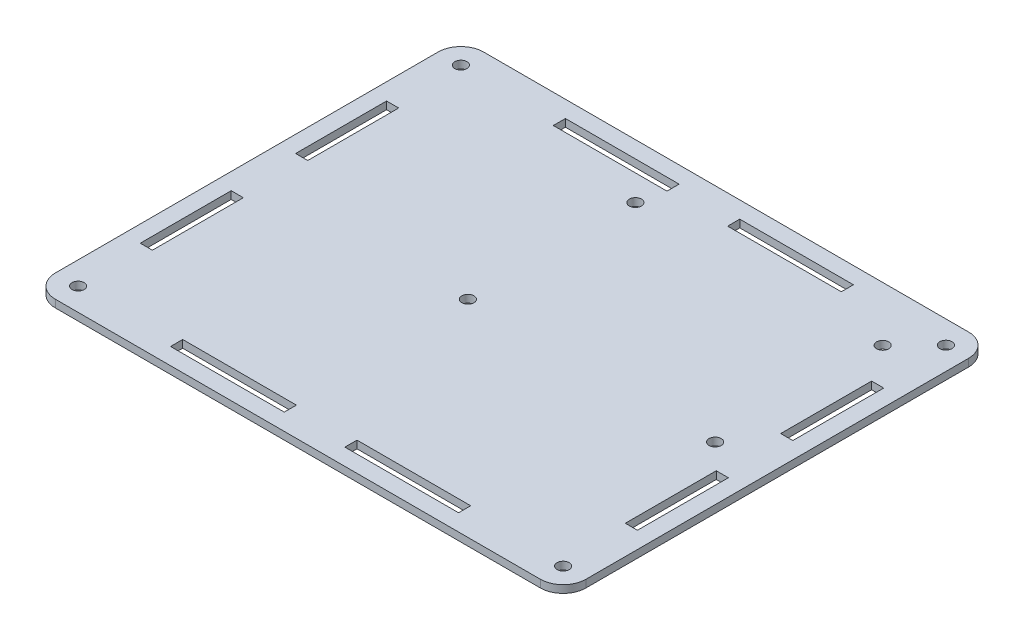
ISO-10303-21;
HEADER;
FILE_DESCRIPTION(('STEP AP214'),'2;1');
FILE_NAME('part.step','',(''),(''),'','','');
FILE_SCHEMA(('AUTOMOTIVE_DESIGN { 1 0 10303 214 1 1 1 1 }'));
ENDSEC;
DATA;
#1=APPLICATION_CONTEXT('core data for automotive mechanical design processes');
#2=APPLICATION_PROTOCOL_DEFINITION('international standard','automotive_design',2000,#1);
#3=PRODUCT_CONTEXT('',#1,'mechanical');
#4=PRODUCT('Part','Part','',(#3));
#5=PRODUCT_RELATED_PRODUCT_CATEGORY('part','',(#4));
#6=PRODUCT_DEFINITION_FORMATION('','',#4);
#7=PRODUCT_DEFINITION_CONTEXT('part definition',#1,'design');
#8=PRODUCT_DEFINITION('design','',#6,#7);
#9=PRODUCT_DEFINITION_SHAPE('','',#8);
#10=(LENGTH_UNIT() NAMED_UNIT(*) SI_UNIT(.MILLI.,.METRE.));
#11=(NAMED_UNIT(*) PLANE_ANGLE_UNIT() SI_UNIT($,.RADIAN.));
#12=(NAMED_UNIT(*) SI_UNIT($,.STERADIAN.) SOLID_ANGLE_UNIT());
#13=UNCERTAINTY_MEASURE_WITH_UNIT(LENGTH_MEASURE(1.E-05),#10,'distance_accuracy_value','');
#14=(GEOMETRIC_REPRESENTATION_CONTEXT(3) GLOBAL_UNCERTAINTY_ASSIGNED_CONTEXT((#13)) GLOBAL_UNIT_ASSIGNED_CONTEXT((#10,
#11,#12)) REPRESENTATION_CONTEXT('',''));
#15=CARTESIAN_POINT('',(0.,0.,0.));
#16=DIRECTION('',(0.,0.,1.));
#17=DIRECTION('',(1.,0.,0.));
#18=AXIS2_PLACEMENT_3D('',#15,#16,#17);
#19=CARTESIAN_POINT('',(0.,2.,0.));
#20=DIRECTION('',(0.,-1.,0.));
#21=DIRECTION('',(0.,0.,-1.));
#22=AXIS2_PLACEMENT_3D('',#19,#20,#21);
#23=PLANE('',#22);
#24=DIRECTION('',(0.,0.,1.));
#25=VECTOR('',#24,1.);
#26=CARTESIAN_POINT('',(4.4,2.,-48.));
#27=LINE('',#26,#25);
#28=CARTESIAN_POINT('',(4.4,2.,-48.));
#29=VERTEX_POINT('',#28);
#30=CARTESIAN_POINT('',(4.4,2.,-24.));
#31=VERTEX_POINT('',#30);
#32=EDGE_CURVE('E333',#29,#31,#27,.T.);
#33=ORIENTED_EDGE('',*,*,#32,.F.);
#34=DIRECTION('',(-1.,0.,0.));
#35=VECTOR('',#34,1.);
#36=CARTESIAN_POINT('',(4.4,2.,-48.));
#37=LINE('',#36,#35);
#38=CARTESIAN_POINT('',(7.6,2.,-48.));
#39=VERTEX_POINT('',#38);
#40=EDGE_CURVE('E341',#39,#29,#37,.T.);
#41=ORIENTED_EDGE('',*,*,#40,.F.);
#42=DIRECTION('',(0.,0.,-1.));
#43=VECTOR('',#42,1.);
#44=CARTESIAN_POINT('',(7.6,2.,-48.));
#45=LINE('',#44,#43);
#46=CARTESIAN_POINT('',(7.6,2.,-24.));
#47=VERTEX_POINT('',#46);
#48=EDGE_CURVE('E338',#47,#39,#45,.T.);
#49=ORIENTED_EDGE('',*,*,#48,.F.);
#50=DIRECTION('',(1.,0.,0.));
#51=VECTOR('',#50,1.);
#52=CARTESIAN_POINT('',(4.4,2.,-24.));
#53=LINE('',#52,#51);
#54=EDGE_CURVE('E335',#31,#47,#53,.T.);
#55=ORIENTED_EDGE('',*,*,#54,.F.);
#56=EDGE_LOOP('',(#33,#41,#49,#55));
#57=FACE_BOUND('',#56,.T.);
#58=DIRECTION('',(0.,0.,-1.));
#59=VECTOR('',#58,1.);
#60=CARTESIAN_POINT('',(108.,2.,-108.6));
#61=LINE('',#60,#59);
#62=CARTESIAN_POINT('',(108.,2.,-105.4));
#63=VERTEX_POINT('',#62);
#64=CARTESIAN_POINT('',(108.,2.,-108.6));
#65=VERTEX_POINT('',#64);
#66=EDGE_CURVE('E395',#63,#65,#61,.T.);
#67=ORIENTED_EDGE('',*,*,#66,.F.);
#68=DIRECTION('',(1.,0.,0.));
#69=VECTOR('',#68,1.);
#70=CARTESIAN_POINT('',(108.,2.,-105.4));
#71=LINE('',#70,#69);
#72=CARTESIAN_POINT('',(78.,2.,-105.4));
#73=VERTEX_POINT('',#72);
#74=EDGE_CURVE('E403',#73,#63,#71,.T.);
#75=ORIENTED_EDGE('',*,*,#74,.F.);
#76=DIRECTION('',(0.,0.,1.));
#77=VECTOR('',#76,1.);
#78=CARTESIAN_POINT('',(78.,2.,-108.6));
#79=LINE('',#78,#77);
#80=CARTESIAN_POINT('',(78.,2.,-108.6));
#81=VERTEX_POINT('',#80);
#82=EDGE_CURVE('E400',#81,#73,#79,.T.);
#83=ORIENTED_EDGE('',*,*,#82,.F.);
#84=DIRECTION('',(-1.,0.,0.));
#85=VECTOR('',#84,1.);
#86=CARTESIAN_POINT('',(108.,2.,-108.6));
#87=LINE('',#86,#85);
#88=EDGE_CURVE('E397',#65,#81,#87,.T.);
#89=ORIENTED_EDGE('',*,*,#88,.F.);
#90=EDGE_LOOP('',(#67,#75,#83,#89));
#91=FACE_BOUND('',#90,.T.);
#92=DIRECTION('',(-1.,0.,0.));
#93=VECTOR('',#92,1.);
#94=CARTESIAN_POINT('',(108.,2.,-7.60000000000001));
#95=LINE('',#94,#93);
#96=CARTESIAN_POINT('',(108.,2.,-7.60000000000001));
#97=VERTEX_POINT('',#96);
#98=CARTESIAN_POINT('',(78.,2.,-7.60000000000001));
#99=VERTEX_POINT('',#98);
#100=EDGE_CURVE('E457',#97,#99,#95,.T.);
#101=ORIENTED_EDGE('',*,*,#100,.F.);
#102=DIRECTION('',(0.,0.,-1.));
#103=VECTOR('',#102,1.);
#104=CARTESIAN_POINT('',(108.,2.,-7.60000000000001));
#105=LINE('',#104,#103);
#106=CARTESIAN_POINT('',(108.,2.,-4.39999999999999));
#107=VERTEX_POINT('',#106);
#108=EDGE_CURVE('E465',#107,#97,#105,.T.);
#109=ORIENTED_EDGE('',*,*,#108,.F.);
#110=DIRECTION('',(1.,0.,0.));
#111=VECTOR('',#110,1.);
#112=CARTESIAN_POINT('',(108.,2.,-4.39999999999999));
#113=LINE('',#112,#111);
#114=CARTESIAN_POINT('',(78.,2.,-4.39999999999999));
#115=VERTEX_POINT('',#114);
#116=EDGE_CURVE('E462',#115,#107,#113,.T.);
#117=ORIENTED_EDGE('',*,*,#116,.F.);
#118=DIRECTION('',(0.,0.,1.));
#119=VECTOR('',#118,1.);
#120=CARTESIAN_POINT('',(78.,2.,-7.60000000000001));
#121=LINE('',#120,#119);
#122=EDGE_CURVE('E459',#99,#115,#121,.T.);
#123=ORIENTED_EDGE('',*,*,#122,.F.);
#124=EDGE_LOOP('',(#101,#109,#117,#123));
#125=FACE_BOUND('',#124,.T.);
#126=CARTESIAN_POINT('',(6.,2.,-6.));
#127=DIRECTION('',(0.,1.,0.));
#128=DIRECTION('',(0.,0.,1.));
#129=AXIS2_PLACEMENT_3D('',#126,#127,#128);
#130=CIRCLE('',#129,1.6);
#131=CARTESIAN_POINT('',(6.,2.,-4.4));
#132=VERTEX_POINT('',#131);
#133=EDGE_CURVE('E519',#132,#132,#130,.T.);
#134=ORIENTED_EDGE('',*,*,#133,.F.);
#135=EDGE_LOOP('',(#134));
#136=FACE_BOUND('',#135,.T.);
#137=CARTESIAN_POINT('',(134.,2.,-6.));
#138=DIRECTION('',(0.,1.,0.));
#139=DIRECTION('',(0.,0.,1.));
#140=AXIS2_PLACEMENT_3D('',#137,#138,#139);
#141=CIRCLE('',#140,1.59999999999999);
#142=CARTESIAN_POINT('',(134.,2.,-4.40000000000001));
#143=VERTEX_POINT('',#142);
#144=EDGE_CURVE('E525',#143,#143,#141,.T.);
#145=ORIENTED_EDGE('',*,*,#144,.F.);
#146=EDGE_LOOP('',(#145));
#147=FACE_BOUND('',#146,.T.);
#148=CARTESIAN_POINT('',(134.,2.,-107.));
#149=DIRECTION('',(0.,1.,0.));
#150=DIRECTION('',(0.,0.,1.));
#151=AXIS2_PLACEMENT_3D('',#148,#149,#150);
#152=CIRCLE('',#151,1.59999999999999);
#153=CARTESIAN_POINT('',(134.,2.,-105.4));
#154=VERTEX_POINT('',#153);
#155=EDGE_CURVE('E531',#154,#154,#152,.T.);
#156=ORIENTED_EDGE('',*,*,#155,.F.);
#157=EDGE_LOOP('',(#156));
#158=FACE_BOUND('',#157,.T.);
#159=CARTESIAN_POINT('',(6.00000000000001,2.,-107.));
#160=DIRECTION('',(0.,1.,0.));
#161=DIRECTION('',(0.,0.,1.));
#162=AXIS2_PLACEMENT_3D('',#159,#160,#161);
#163=CIRCLE('',#162,1.60000000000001);
#164=CARTESIAN_POINT('',(6.00000000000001,2.,-105.4));
#165=VERTEX_POINT('',#164);
#166=EDGE_CURVE('E537',#165,#165,#163,.T.);
#167=ORIENTED_EDGE('',*,*,#166,.F.);
#168=EDGE_LOOP('',(#167));
#169=FACE_BOUND('',#168,.T.);
#170=CARTESIAN_POINT('',(60.437,2.,-54.418));
#171=DIRECTION('',(0.,1.,0.));
#172=DIRECTION('',(0.,0.,1.));
#173=AXIS2_PLACEMENT_3D('',#170,#171,#172);
#174=CIRCLE('',#173,1.60000000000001);
#175=CARTESIAN_POINT('',(60.437,2.,-52.818));
#176=VERTEX_POINT('',#175);
#177=EDGE_CURVE('E543',#176,#176,#174,.T.);
#178=ORIENTED_EDGE('',*,*,#177,.F.);
#179=EDGE_LOOP('',(#178));
#180=FACE_BOUND('',#179,.T.);
#181=CARTESIAN_POINT('',(125.69,2.,-54.418));
#182=DIRECTION('',(0.,1.,0.));
#183=DIRECTION('',(0.,0.,1.));
#184=AXIS2_PLACEMENT_3D('',#181,#182,#183);
#185=CIRCLE('',#184,1.60000000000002);
#186=CARTESIAN_POINT('',(125.69,2.,-52.818));
#187=VERTEX_POINT('',#186);
#188=EDGE_CURVE('E549',#187,#187,#185,.T.);
#189=ORIENTED_EDGE('',*,*,#188,.F.);
#190=EDGE_LOOP('',(#189));
#191=FACE_BOUND('',#190,.T.);
#192=CARTESIAN_POINT('',(125.69,2.,-98.62));
#193=DIRECTION('',(0.,1.,0.));
#194=DIRECTION('',(0.,0.,1.));
#195=AXIS2_PLACEMENT_3D('',#192,#193,#194);
#196=CIRCLE('',#195,1.60000000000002);
#197=CARTESIAN_POINT('',(125.69,2.,-97.02));
#198=VERTEX_POINT('',#197);
#199=EDGE_CURVE('E555',#198,#198,#196,.T.);
#200=ORIENTED_EDGE('',*,*,#199,.F.);
#201=EDGE_LOOP('',(#200));
#202=FACE_BOUND('',#201,.T.);
#203=CARTESIAN_POINT('',(60.437,2.,-98.62));
#204=DIRECTION('',(0.,1.,0.));
#205=DIRECTION('',(0.,0.,1.));
#206=AXIS2_PLACEMENT_3D('',#203,#204,#205);
#207=CIRCLE('',#206,1.60000000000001);
#208=CARTESIAN_POINT('',(60.437,2.,-97.02));
#209=VERTEX_POINT('',#208);
#210=EDGE_CURVE('E561',#209,#209,#207,.T.);
#211=ORIENTED_EDGE('',*,*,#210,.F.);
#212=EDGE_LOOP('',(#211));
#213=FACE_BOUND('',#212,.T.);
#214=DIRECTION('',(0.,0.,-1.));
#215=VECTOR('',#214,1.);
#216=CARTESIAN_POINT('',(135.6,2.,-48.));
#217=LINE('',#216,#215);
#218=CARTESIAN_POINT('',(135.6,2.,-24.));
#219=VERTEX_POINT('',#218);
#220=CARTESIAN_POINT('',(135.6,2.,-48.));
#221=VERTEX_POINT('',#220);
#222=EDGE_CURVE('E567',#219,#221,#217,.T.);
#223=ORIENTED_EDGE('',*,*,#222,.F.);
#224=DIRECTION('',(1.,0.,0.));
#225=VECTOR('',#224,1.);
#226=CARTESIAN_POINT('',(135.6,2.,-24.));
#227=LINE('',#226,#225);
#228=CARTESIAN_POINT('',(132.4,2.,-24.));
#229=VERTEX_POINT('',#228);
#230=EDGE_CURVE('E575',#229,#219,#227,.T.);
#231=ORIENTED_EDGE('',*,*,#230,.F.);
#232=DIRECTION('',(0.,0.,1.));
#233=VECTOR('',#232,1.);
#234=CARTESIAN_POINT('',(132.4,2.,-48.));
#235=LINE('',#234,#233);
#236=CARTESIAN_POINT('',(132.4,2.,-48.));
#237=VERTEX_POINT('',#236);
#238=EDGE_CURVE('E572',#237,#229,#235,.T.);
#239=ORIENTED_EDGE('',*,*,#238,.F.);
#240=DIRECTION('',(-1.,0.,0.));
#241=VECTOR('',#240,1.);
#242=CARTESIAN_POINT('',(135.6,2.,-48.));
#243=LINE('',#242,#241);
#244=EDGE_CURVE('E569',#221,#237,#243,.T.);
#245=ORIENTED_EDGE('',*,*,#244,.F.);
#246=EDGE_LOOP('',(#223,#231,#239,#245));
#247=FACE_BOUND('',#246,.T.);
#248=DIRECTION('',(0.,0.,-1.));
#249=VECTOR('',#248,1.);
#250=CARTESIAN_POINT('',(140.,2.,0.));
#251=LINE('',#250,#249);
#252=CARTESIAN_POINT('',(140.,2.,-6.));
#253=VERTEX_POINT('',#252);
#254=CARTESIAN_POINT('',(140.,2.,-107.));
#255=VERTEX_POINT('',#254);
#256=EDGE_CURVE('E604',#253,#255,#251,.T.);
#257=ORIENTED_EDGE('',*,*,#256,.T.);
#258=CARTESIAN_POINT('',(134.,2.,-107.));
#259=DIRECTION('',(0.,-1.,0.));
#260=DIRECTION('',(0.,0.,-1.));
#261=AXIS2_PLACEMENT_3D('',#258,#259,#260);
#262=CIRCLE('',#261,6.);
#263=CARTESIAN_POINT('',(134.,2.,-113.));
#264=VERTEX_POINT('',#263);
#265=EDGE_CURVE('E40',#255,#264,#262,.F.);
#266=ORIENTED_EDGE('',*,*,#265,.T.);
#267=DIRECTION('',(-1.,0.,0.));
#268=VECTOR('',#267,1.);
#269=CARTESIAN_POINT('',(0.,2.,-113.));
#270=LINE('',#269,#268);
#271=CARTESIAN_POINT('',(6.,2.,-113.));
#272=VERTEX_POINT('',#271);
#273=EDGE_CURVE('E606',#264,#272,#270,.T.);
#274=ORIENTED_EDGE('',*,*,#273,.T.);
#275=CARTESIAN_POINT('',(6.,2.,-107.));
#276=DIRECTION('',(0.,-1.,0.));
#277=DIRECTION('',(0.,0.,-1.));
#278=AXIS2_PLACEMENT_3D('',#275,#276,#277);
#279=CIRCLE('',#278,6.);
#280=CARTESIAN_POINT('',(0.,2.,-107.));
#281=VERTEX_POINT('',#280);
#282=EDGE_CURVE('E624',#272,#281,#279,.F.);
#283=ORIENTED_EDGE('',*,*,#282,.T.);
#284=DIRECTION('',(0.,0.,1.));
#285=VECTOR('',#284,1.);
#286=CARTESIAN_POINT('',(0.,2.,0.));
#287=LINE('',#286,#285);
#288=CARTESIAN_POINT('',(0.,2.,-6.));
#289=VERTEX_POINT('',#288);
#290=EDGE_CURVE('E598',#281,#289,#287,.T.);
#291=ORIENTED_EDGE('',*,*,#290,.T.);
#292=CARTESIAN_POINT('',(6.,2.,-6.));
#293=DIRECTION('',(0.,-1.,0.));
#294=DIRECTION('',(0.,0.,-1.));
#295=AXIS2_PLACEMENT_3D('',#292,#293,#294);
#296=CIRCLE('',#295,6.);
#297=CARTESIAN_POINT('',(6.,2.,0.));
#298=VERTEX_POINT('',#297);
#299=EDGE_CURVE('E633',#289,#298,#296,.F.);
#300=ORIENTED_EDGE('',*,*,#299,.T.);
#301=DIRECTION('',(1.,0.,0.));
#302=VECTOR('',#301,1.);
#303=CARTESIAN_POINT('',(0.,2.,0.));
#304=LINE('',#303,#302);
#305=CARTESIAN_POINT('',(134.,2.,0.));
#306=VERTEX_POINT('',#305);
#307=EDGE_CURVE('E601',#298,#306,#304,.T.);
#308=ORIENTED_EDGE('',*,*,#307,.T.);
#309=CARTESIAN_POINT('',(134.,2.,-6.));
#310=DIRECTION('',(0.,-1.,0.));
#311=DIRECTION('',(0.,0.,-1.));
#312=AXIS2_PLACEMENT_3D('',#309,#310,#311);
#313=CIRCLE('',#312,6.);
#314=EDGE_CURVE('E646',#306,#253,#313,.F.);
#315=ORIENTED_EDGE('',*,*,#314,.T.);
#316=EDGE_LOOP('',(#257,#266,#274,#283,#291,#300,#308,#315));
#317=FACE_BOUND('',#316,.T.);
#318=DIRECTION('',(0.,0.,1.));
#319=VECTOR('',#318,1.);
#320=CARTESIAN_POINT('',(32.,2.,-108.6));
#321=LINE('',#320,#319);
#322=CARTESIAN_POINT('',(32.,2.,-108.6));
#323=VERTEX_POINT('',#322);
#324=CARTESIAN_POINT('',(32.,2.,-105.4));
#325=VERTEX_POINT('',#324);
#326=EDGE_CURVE('E488',#323,#325,#321,.T.);
#327=ORIENTED_EDGE('',*,*,#326,.F.);
#328=DIRECTION('',(-1.,0.,0.));
#329=VECTOR('',#328,1.);
#330=CARTESIAN_POINT('',(32.,2.,-108.6));
#331=LINE('',#330,#329);
#332=CARTESIAN_POINT('',(62.,2.,-108.6));
#333=VERTEX_POINT('',#332);
#334=EDGE_CURVE('E496',#333,#323,#331,.T.);
#335=ORIENTED_EDGE('',*,*,#334,.F.);
#336=DIRECTION('',(0.,0.,-1.));
#337=VECTOR('',#336,1.);
#338=CARTESIAN_POINT('',(62.,2.,-108.6));
#339=LINE('',#338,#337);
#340=CARTESIAN_POINT('',(62.,2.,-105.4));
#341=VERTEX_POINT('',#340);
#342=EDGE_CURVE('E493',#341,#333,#339,.T.);
#343=ORIENTED_EDGE('',*,*,#342,.F.);
#344=DIRECTION('',(1.,0.,0.));
#345=VECTOR('',#344,1.);
#346=CARTESIAN_POINT('',(32.,2.,-105.4));
#347=LINE('',#346,#345);
#348=EDGE_CURVE('E490',#325,#341,#347,.T.);
#349=ORIENTED_EDGE('',*,*,#348,.F.);
#350=EDGE_LOOP('',(#327,#335,#343,#349));
#351=FACE_BOUND('',#350,.T.);
#352=DIRECTION('',(0.,0.,1.));
#353=VECTOR('',#352,1.);
#354=CARTESIAN_POINT('',(32.,2.,-7.60000000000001));
#355=LINE('',#354,#353);
#356=CARTESIAN_POINT('',(32.,2.,-7.60000000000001));
#357=VERTEX_POINT('',#356);
#358=CARTESIAN_POINT('',(32.,2.,-4.39999999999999));
#359=VERTEX_POINT('',#358);
#360=EDGE_CURVE('E426',#357,#359,#355,.T.);
#361=ORIENTED_EDGE('',*,*,#360,.F.);
#362=DIRECTION('',(-1.,0.,0.));
#363=VECTOR('',#362,1.);
#364=CARTESIAN_POINT('',(32.,2.,-7.60000000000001));
#365=LINE('',#364,#363);
#366=CARTESIAN_POINT('',(62.,2.,-7.60000000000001));
#367=VERTEX_POINT('',#366);
#368=EDGE_CURVE('E434',#367,#357,#365,.T.);
#369=ORIENTED_EDGE('',*,*,#368,.F.);
#370=DIRECTION('',(0.,0.,-1.));
#371=VECTOR('',#370,1.);
#372=CARTESIAN_POINT('',(62.,2.,-7.60000000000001));
#373=LINE('',#372,#371);
#374=CARTESIAN_POINT('',(62.,2.,-4.39999999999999));
#375=VERTEX_POINT('',#374);
#376=EDGE_CURVE('E431',#375,#367,#373,.T.);
#377=ORIENTED_EDGE('',*,*,#376,.F.);
#378=DIRECTION('',(1.,0.,0.));
#379=VECTOR('',#378,1.);
#380=CARTESIAN_POINT('',(32.,2.,-4.39999999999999));
#381=LINE('',#380,#379);
#382=EDGE_CURVE('E428',#359,#375,#381,.T.);
#383=ORIENTED_EDGE('',*,*,#382,.F.);
#384=EDGE_LOOP('',(#361,#369,#377,#383));
#385=FACE_BOUND('',#384,.T.);
#386=DIRECTION('',(0.,0.,1.));
#387=VECTOR('',#386,1.);
#388=CARTESIAN_POINT('',(4.4,2.,-89.));
#389=LINE('',#388,#387);
#390=CARTESIAN_POINT('',(4.4,2.,-89.));
#391=VERTEX_POINT('',#390);
#392=CARTESIAN_POINT('',(4.4,2.,-65.));
#393=VERTEX_POINT('',#392);
#394=EDGE_CURVE('E364',#391,#393,#389,.T.);
#395=ORIENTED_EDGE('',*,*,#394,.F.);
#396=DIRECTION('',(-1.,0.,0.));
#397=VECTOR('',#396,1.);
#398=CARTESIAN_POINT('',(4.4,2.,-89.));
#399=LINE('',#398,#397);
#400=CARTESIAN_POINT('',(7.6,2.,-89.));
#401=VERTEX_POINT('',#400);
#402=EDGE_CURVE('E372',#401,#391,#399,.T.);
#403=ORIENTED_EDGE('',*,*,#402,.F.);
#404=DIRECTION('',(0.,0.,-1.));
#405=VECTOR('',#404,1.);
#406=CARTESIAN_POINT('',(7.6,2.,-89.));
#407=LINE('',#406,#405);
#408=CARTESIAN_POINT('',(7.6,2.,-65.));
#409=VERTEX_POINT('',#408);
#410=EDGE_CURVE('E369',#409,#401,#407,.T.);
#411=ORIENTED_EDGE('',*,*,#410,.F.);
#412=DIRECTION('',(1.,0.,0.));
#413=VECTOR('',#412,1.);
#414=CARTESIAN_POINT('',(4.4,2.,-65.));
#415=LINE('',#414,#413);
#416=EDGE_CURVE('E366',#393,#409,#415,.T.);
#417=ORIENTED_EDGE('',*,*,#416,.F.);
#418=EDGE_LOOP('',(#395,#403,#411,#417));
#419=FACE_BOUND('',#418,.T.);
#420=DIRECTION('',(0.,0.,-1.));
#421=VECTOR('',#420,1.);
#422=CARTESIAN_POINT('',(135.6,2.,-89.));
#423=LINE('',#422,#421);
#424=CARTESIAN_POINT('',(135.6,2.,-65.));
#425=VERTEX_POINT('',#424);
#426=CARTESIAN_POINT('',(135.6,2.,-89.));
#427=VERTEX_POINT('',#426);
#428=EDGE_CURVE('E292',#425,#427,#423,.T.);
#429=ORIENTED_EDGE('',*,*,#428,.F.);
#430=DIRECTION('',(1.,0.,0.));
#431=VECTOR('',#430,1.);
#432=CARTESIAN_POINT('',(135.6,2.,-65.));
#433=LINE('',#432,#431);
#434=CARTESIAN_POINT('',(132.4,2.,-65.));
#435=VERTEX_POINT('',#434);
#436=EDGE_CURVE('E317',#435,#425,#433,.T.);
#437=ORIENTED_EDGE('',*,*,#436,.F.);
#438=DIRECTION('',(0.,0.,1.));
#439=VECTOR('',#438,1.);
#440=CARTESIAN_POINT('',(132.4,2.,-89.));
#441=LINE('',#440,#439);
#442=CARTESIAN_POINT('',(132.4,2.,-89.));
#443=VERTEX_POINT('',#442);
#444=EDGE_CURVE('E315',#443,#435,#441,.T.);
#445=ORIENTED_EDGE('',*,*,#444,.F.);
#446=DIRECTION('',(-1.,0.,0.));
#447=VECTOR('',#446,1.);
#448=CARTESIAN_POINT('',(135.6,2.,-89.));
#449=LINE('',#448,#447);
#450=EDGE_CURVE('E302',#427,#443,#449,.T.);
#451=ORIENTED_EDGE('',*,*,#450,.F.);
#452=EDGE_LOOP('',(#429,#437,#445,#451));
#453=FACE_BOUND('',#452,.T.);
#454=ADVANCED_FACE('F32',(#57,#91,#125,#136,#147,#158,#169,#180,#191,#202,#213,#247,#317,#351,
#385,#419,#453),#23,.F.);
#455=CARTESIAN_POINT('',(0.,0.,0.));
#456=DIRECTION('',(0.,-1.,0.));
#457=DIRECTION('',(0.,0.,-1.));
#458=AXIS2_PLACEMENT_3D('',#455,#456,#457);
#459=PLANE('',#458);
#460=CARTESIAN_POINT('',(134.,0.,-6.));
#461=DIRECTION('',(0.,1.,0.));
#462=DIRECTION('',(0.,0.,1.));
#463=AXIS2_PLACEMENT_3D('',#460,#461,#462);
#464=CIRCLE('',#463,1.59999999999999);
#465=CARTESIAN_POINT('',(134.,0.,-4.40000000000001));
#466=VERTEX_POINT('',#465);
#467=EDGE_CURVE('E522',#466,#466,#464,.T.);
#468=ORIENTED_EDGE('',*,*,#467,.T.);
#469=EDGE_LOOP('',(#468));
#470=FACE_BOUND('',#469,.T.);
#471=CARTESIAN_POINT('',(6.00000000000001,0.,-107.));
#472=DIRECTION('',(0.,1.,0.));
#473=DIRECTION('',(0.,0.,1.));
#474=AXIS2_PLACEMENT_3D('',#471,#472,#473);
#475=CIRCLE('',#474,1.60000000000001);
#476=CARTESIAN_POINT('',(6.00000000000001,0.,-105.4));
#477=VERTEX_POINT('',#476);
#478=EDGE_CURVE('E534',#477,#477,#475,.T.);
#479=ORIENTED_EDGE('',*,*,#478,.T.);
#480=EDGE_LOOP('',(#479));
#481=FACE_BOUND('',#480,.T.);
#482=CARTESIAN_POINT('',(125.69,0.,-54.418));
#483=DIRECTION('',(0.,1.,0.));
#484=DIRECTION('',(0.,0.,1.));
#485=AXIS2_PLACEMENT_3D('',#482,#483,#484);
#486=CIRCLE('',#485,1.60000000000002);
#487=CARTESIAN_POINT('',(125.69,0.,-52.818));
#488=VERTEX_POINT('',#487);
#489=EDGE_CURVE('E546',#488,#488,#486,.T.);
#490=ORIENTED_EDGE('',*,*,#489,.T.);
#491=EDGE_LOOP('',(#490));
#492=FACE_BOUND('',#491,.T.);
#493=CARTESIAN_POINT('',(60.437,0.,-98.62));
#494=DIRECTION('',(0.,1.,0.));
#495=DIRECTION('',(0.,0.,1.));
#496=AXIS2_PLACEMENT_3D('',#493,#494,#495);
#497=CIRCLE('',#496,1.60000000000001);
#498=CARTESIAN_POINT('',(60.437,0.,-97.02));
#499=VERTEX_POINT('',#498);
#500=EDGE_CURVE('E558',#499,#499,#497,.T.);
#501=ORIENTED_EDGE('',*,*,#500,.T.);
#502=EDGE_LOOP('',(#501));
#503=FACE_BOUND('',#502,.T.);
#504=DIRECTION('',(-1.,0.,0.));
#505=VECTOR('',#504,1.);
#506=CARTESIAN_POINT('',(0.,0.,-113.));
#507=LINE('',#506,#505);
#508=CARTESIAN_POINT('',(134.,0.,-113.));
#509=VERTEX_POINT('',#508);
#510=CARTESIAN_POINT('',(6.,0.,-113.));
#511=VERTEX_POINT('',#510);
#512=EDGE_CURVE('E602',#509,#511,#507,.T.);
#513=ORIENTED_EDGE('',*,*,#512,.F.);
#514=CARTESIAN_POINT('',(134.,0.,-107.));
#515=DIRECTION('',(0.,-1.,0.));
#516=DIRECTION('',(0.,0.,-1.));
#517=AXIS2_PLACEMENT_3D('',#514,#515,#516);
#518=CIRCLE('',#517,6.);
#519=CARTESIAN_POINT('',(140.,0.,-107.));
#520=VERTEX_POINT('',#519);
#521=EDGE_CURVE('E640',#509,#520,#518,.T.);
#522=ORIENTED_EDGE('',*,*,#521,.T.);
#523=DIRECTION('',(0.,0.,-1.));
#524=VECTOR('',#523,1.);
#525=CARTESIAN_POINT('',(140.,0.,0.));
#526=LINE('',#525,#524);
#527=CARTESIAN_POINT('',(140.,0.,-6.));
#528=VERTEX_POINT('',#527);
#529=EDGE_CURVE('E613',#528,#520,#526,.T.);
#530=ORIENTED_EDGE('',*,*,#529,.F.);
#531=CARTESIAN_POINT('',(134.,0.,-6.));
#532=DIRECTION('',(0.,-1.,0.));
#533=DIRECTION('',(0.,0.,-1.));
#534=AXIS2_PLACEMENT_3D('',#531,#532,#533);
#535=CIRCLE('',#534,6.);
#536=CARTESIAN_POINT('',(134.,0.,0.));
#537=VERTEX_POINT('',#536);
#538=EDGE_CURVE('E638',#528,#537,#535,.T.);
#539=ORIENTED_EDGE('',*,*,#538,.T.);
#540=DIRECTION('',(1.,0.,0.));
#541=VECTOR('',#540,1.);
#542=CARTESIAN_POINT('',(0.,0.,0.));
#543=LINE('',#542,#541);
#544=CARTESIAN_POINT('',(6.,0.,0.));
#545=VERTEX_POINT('',#544);
#546=EDGE_CURVE('E611',#545,#537,#543,.T.);
#547=ORIENTED_EDGE('',*,*,#546,.F.);
#548=CARTESIAN_POINT('',(6.,0.,-6.));
#549=DIRECTION('',(0.,-1.,0.));
#550=DIRECTION('',(0.,0.,-1.));
#551=AXIS2_PLACEMENT_3D('',#548,#549,#550);
#552=CIRCLE('',#551,6.);
#553=CARTESIAN_POINT('',(0.,0.,-6.));
#554=VERTEX_POINT('',#553);
#555=EDGE_CURVE('E629',#545,#554,#552,.T.);
#556=ORIENTED_EDGE('',*,*,#555,.T.);
#557=DIRECTION('',(0.,0.,1.));
#558=VECTOR('',#557,1.);
#559=CARTESIAN_POINT('',(0.,0.,0.));
#560=LINE('',#559,#558);
#561=CARTESIAN_POINT('',(0.,0.,-107.));
#562=VERTEX_POINT('',#561);
#563=EDGE_CURVE('E597',#562,#554,#560,.T.);
#564=ORIENTED_EDGE('',*,*,#563,.F.);
#565=CARTESIAN_POINT('',(6.,0.,-107.));
#566=DIRECTION('',(0.,-1.,0.));
#567=DIRECTION('',(0.,0.,-1.));
#568=AXIS2_PLACEMENT_3D('',#565,#566,#567);
#569=CIRCLE('',#568,6.);
#570=EDGE_CURVE('E618',#562,#511,#569,.T.);
#571=ORIENTED_EDGE('',*,*,#570,.T.);
#572=EDGE_LOOP('',(#513,#522,#530,#539,#547,#556,#564,#571));
#573=FACE_BOUND('',#572,.T.);
#574=DIRECTION('',(1.,0.,0.));
#575=VECTOR('',#574,1.);
#576=CARTESIAN_POINT('',(135.6,0.,-24.));
#577=LINE('',#576,#575);
#578=CARTESIAN_POINT('',(132.4,0.,-24.));
#579=VERTEX_POINT('',#578);
#580=CARTESIAN_POINT('',(135.6,0.,-24.));
#581=VERTEX_POINT('',#580);
#582=EDGE_CURVE('E570',#579,#581,#577,.T.);
#583=ORIENTED_EDGE('',*,*,#582,.T.);
#584=DIRECTION('',(0.,0.,-1.));
#585=VECTOR('',#584,1.);
#586=CARTESIAN_POINT('',(135.6,0.,-48.));
#587=LINE('',#586,#585);
#588=CARTESIAN_POINT('',(135.6,0.,-48.));
#589=VERTEX_POINT('',#588);
#590=EDGE_CURVE('E564',#581,#589,#587,.T.);
#591=ORIENTED_EDGE('',*,*,#590,.T.);
#592=DIRECTION('',(-1.,0.,0.));
#593=VECTOR('',#592,1.);
#594=CARTESIAN_POINT('',(135.6,0.,-48.));
#595=LINE('',#594,#593);
#596=CARTESIAN_POINT('',(132.4,0.,-48.));
#597=VERTEX_POINT('',#596);
#598=EDGE_CURVE('E580',#589,#597,#595,.T.);
#599=ORIENTED_EDGE('',*,*,#598,.T.);
#600=DIRECTION('',(0.,0.,1.));
#601=VECTOR('',#600,1.);
#602=CARTESIAN_POINT('',(132.4,0.,-48.));
#603=LINE('',#602,#601);
#604=EDGE_CURVE('E583',#597,#579,#603,.T.);
#605=ORIENTED_EDGE('',*,*,#604,.T.);
#606=EDGE_LOOP('',(#583,#591,#599,#605));
#607=FACE_BOUND('',#606,.T.);
#608=CARTESIAN_POINT('',(125.69,0.,-98.62));
#609=DIRECTION('',(0.,1.,0.));
#610=DIRECTION('',(0.,0.,1.));
#611=AXIS2_PLACEMENT_3D('',#608,#609,#610);
#612=CIRCLE('',#611,1.60000000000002);
#613=CARTESIAN_POINT('',(125.69,0.,-97.02));
#614=VERTEX_POINT('',#613);
#615=EDGE_CURVE('E552',#614,#614,#612,.T.);
#616=ORIENTED_EDGE('',*,*,#615,.T.);
#617=EDGE_LOOP('',(#616));
#618=FACE_BOUND('',#617,.T.);
#619=CARTESIAN_POINT('',(60.437,0.,-54.418));
#620=DIRECTION('',(0.,1.,0.));
#621=DIRECTION('',(0.,0.,1.));
#622=AXIS2_PLACEMENT_3D('',#619,#620,#621);
#623=CIRCLE('',#622,1.60000000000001);
#624=CARTESIAN_POINT('',(60.437,0.,-52.818));
#625=VERTEX_POINT('',#624);
#626=EDGE_CURVE('E540',#625,#625,#623,.T.);
#627=ORIENTED_EDGE('',*,*,#626,.T.);
#628=EDGE_LOOP('',(#627));
#629=FACE_BOUND('',#628,.T.);
#630=CARTESIAN_POINT('',(134.,0.,-107.));
#631=DIRECTION('',(0.,1.,0.));
#632=DIRECTION('',(0.,0.,1.));
#633=AXIS2_PLACEMENT_3D('',#630,#631,#632);
#634=CIRCLE('',#633,1.59999999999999);
#635=CARTESIAN_POINT('',(134.,0.,-105.4));
#636=VERTEX_POINT('',#635);
#637=EDGE_CURVE('E528',#636,#636,#634,.T.);
#638=ORIENTED_EDGE('',*,*,#637,.T.);
#639=EDGE_LOOP('',(#638));
#640=FACE_BOUND('',#639,.T.);
#641=CARTESIAN_POINT('',(6.,0.,-6.));
#642=DIRECTION('',(0.,1.,0.));
#643=DIRECTION('',(0.,0.,1.));
#644=AXIS2_PLACEMENT_3D('',#641,#642,#643);
#645=CIRCLE('',#644,1.6);
#646=CARTESIAN_POINT('',(6.,0.,-4.4));
#647=VERTEX_POINT('',#646);
#648=EDGE_CURVE('E518',#647,#647,#645,.T.);
#649=ORIENTED_EDGE('',*,*,#648,.T.);
#650=EDGE_LOOP('',(#649));
#651=FACE_BOUND('',#650,.T.);
#652=DIRECTION('',(-1.,0.,0.));
#653=VECTOR('',#652,1.);
#654=CARTESIAN_POINT('',(32.,0.,-108.6));
#655=LINE('',#654,#653);
#656=CARTESIAN_POINT('',(62.,0.,-108.6));
#657=VERTEX_POINT('',#656);
#658=CARTESIAN_POINT('',(32.,0.,-108.6));
#659=VERTEX_POINT('',#658);
#660=EDGE_CURVE('E491',#657,#659,#655,.T.);
#661=ORIENTED_EDGE('',*,*,#660,.T.);
#662=DIRECTION('',(0.,0.,1.));
#663=VECTOR('',#662,1.);
#664=CARTESIAN_POINT('',(32.,0.,-108.6));
#665=LINE('',#664,#663);
#666=CARTESIAN_POINT('',(32.,0.,-105.4));
#667=VERTEX_POINT('',#666);
#668=EDGE_CURVE('E487',#659,#667,#665,.T.);
#669=ORIENTED_EDGE('',*,*,#668,.T.);
#670=DIRECTION('',(1.,0.,0.));
#671=VECTOR('',#670,1.);
#672=CARTESIAN_POINT('',(32.,0.,-105.4));
#673=LINE('',#672,#671);
#674=CARTESIAN_POINT('',(62.,0.,-105.4));
#675=VERTEX_POINT('',#674);
#676=EDGE_CURVE('E501',#667,#675,#673,.T.);
#677=ORIENTED_EDGE('',*,*,#676,.T.);
#678=DIRECTION('',(0.,0.,-1.));
#679=VECTOR('',#678,1.);
#680=CARTESIAN_POINT('',(62.,0.,-108.6));
#681=LINE('',#680,#679);
#682=EDGE_CURVE('E504',#675,#657,#681,.T.);
#683=ORIENTED_EDGE('',*,*,#682,.T.);
#684=EDGE_LOOP('',(#661,#669,#677,#683));
#685=FACE_BOUND('',#684,.T.);
#686=DIRECTION('',(0.,0.,-1.));
#687=VECTOR('',#686,1.);
#688=CARTESIAN_POINT('',(108.,0.,-7.60000000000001));
#689=LINE('',#688,#687);
#690=CARTESIAN_POINT('',(108.,0.,-4.39999999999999));
#691=VERTEX_POINT('',#690);
#692=CARTESIAN_POINT('',(108.,0.,-7.60000000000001));
#693=VERTEX_POINT('',#692);
#694=EDGE_CURVE('E460',#691,#693,#689,.T.);
#695=ORIENTED_EDGE('',*,*,#694,.T.);
#696=DIRECTION('',(-1.,0.,0.));
#697=VECTOR('',#696,1.);
#698=CARTESIAN_POINT('',(108.,0.,-7.60000000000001));
#699=LINE('',#698,#697);
#700=CARTESIAN_POINT('',(78.,0.,-7.60000000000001));
#701=VERTEX_POINT('',#700);
#702=EDGE_CURVE('E456',#693,#701,#699,.T.);
#703=ORIENTED_EDGE('',*,*,#702,.T.);
#704=DIRECTION('',(0.,0.,1.));
#705=VECTOR('',#704,1.);
#706=CARTESIAN_POINT('',(78.,0.,-7.60000000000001));
#707=LINE('',#706,#705);
#708=CARTESIAN_POINT('',(78.,0.,-4.39999999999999));
#709=VERTEX_POINT('',#708);
#710=EDGE_CURVE('E470',#701,#709,#707,.T.);
#711=ORIENTED_EDGE('',*,*,#710,.T.);
#712=DIRECTION('',(1.,0.,0.));
#713=VECTOR('',#712,1.);
#714=CARTESIAN_POINT('',(108.,0.,-4.39999999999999));
#715=LINE('',#714,#713);
#716=EDGE_CURVE('E473',#709,#691,#715,.T.);
#717=ORIENTED_EDGE('',*,*,#716,.T.);
#718=EDGE_LOOP('',(#695,#703,#711,#717));
#719=FACE_BOUND('',#718,.T.);
#720=DIRECTION('',(-1.,0.,0.));
#721=VECTOR('',#720,1.);
#722=CARTESIAN_POINT('',(32.,0.,-7.60000000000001));
#723=LINE('',#722,#721);
#724=CARTESIAN_POINT('',(62.,0.,-7.60000000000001));
#725=VERTEX_POINT('',#724);
#726=CARTESIAN_POINT('',(32.,0.,-7.60000000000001));
#727=VERTEX_POINT('',#726);
#728=EDGE_CURVE('E429',#725,#727,#723,.T.);
#729=ORIENTED_EDGE('',*,*,#728,.T.);
#730=DIRECTION('',(0.,0.,1.));
#731=VECTOR('',#730,1.);
#732=CARTESIAN_POINT('',(32.,0.,-7.60000000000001));
#733=LINE('',#732,#731);
#734=CARTESIAN_POINT('',(32.,0.,-4.39999999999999));
#735=VERTEX_POINT('',#734);
#736=EDGE_CURVE('E425',#727,#735,#733,.T.);
#737=ORIENTED_EDGE('',*,*,#736,.T.);
#738=DIRECTION('',(1.,0.,0.));
#739=VECTOR('',#738,1.);
#740=CARTESIAN_POINT('',(32.,0.,-4.39999999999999));
#741=LINE('',#740,#739);
#742=CARTESIAN_POINT('',(62.,0.,-4.39999999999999));
#743=VERTEX_POINT('',#742);
#744=EDGE_CURVE('E439',#735,#743,#741,.T.);
#745=ORIENTED_EDGE('',*,*,#744,.T.);
#746=DIRECTION('',(0.,0.,-1.));
#747=VECTOR('',#746,1.);
#748=CARTESIAN_POINT('',(62.,0.,-7.60000000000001));
#749=LINE('',#748,#747);
#750=EDGE_CURVE('E442',#743,#725,#749,.T.);
#751=ORIENTED_EDGE('',*,*,#750,.T.);
#752=EDGE_LOOP('',(#729,#737,#745,#751));
#753=FACE_BOUND('',#752,.T.);
#754=DIRECTION('',(1.,0.,0.));
#755=VECTOR('',#754,1.);
#756=CARTESIAN_POINT('',(108.,0.,-105.4));
#757=LINE('',#756,#755);
#758=CARTESIAN_POINT('',(78.,0.,-105.4));
#759=VERTEX_POINT('',#758);
#760=CARTESIAN_POINT('',(108.,0.,-105.4));
#761=VERTEX_POINT('',#760);
#762=EDGE_CURVE('E398',#759,#761,#757,.T.);
#763=ORIENTED_EDGE('',*,*,#762,.T.);
#764=DIRECTION('',(0.,0.,-1.));
#765=VECTOR('',#764,1.);
#766=CARTESIAN_POINT('',(108.,0.,-108.6));
#767=LINE('',#766,#765);
#768=CARTESIAN_POINT('',(108.,0.,-108.6));
#769=VERTEX_POINT('',#768);
#770=EDGE_CURVE('E394',#761,#769,#767,.T.);
#771=ORIENTED_EDGE('',*,*,#770,.T.);
#772=DIRECTION('',(-1.,0.,0.));
#773=VECTOR('',#772,1.);
#774=CARTESIAN_POINT('',(108.,0.,-108.6));
#775=LINE('',#774,#773);
#776=CARTESIAN_POINT('',(78.,0.,-108.6));
#777=VERTEX_POINT('',#776);
#778=EDGE_CURVE('E408',#769,#777,#775,.T.);
#779=ORIENTED_EDGE('',*,*,#778,.T.);
#780=DIRECTION('',(0.,0.,1.));
#781=VECTOR('',#780,1.);
#782=CARTESIAN_POINT('',(78.,0.,-108.6));
#783=LINE('',#782,#781);
#784=EDGE_CURVE('E411',#777,#759,#783,.T.);
#785=ORIENTED_EDGE('',*,*,#784,.T.);
#786=EDGE_LOOP('',(#763,#771,#779,#785));
#787=FACE_BOUND('',#786,.T.);
#788=DIRECTION('',(-1.,0.,0.));
#789=VECTOR('',#788,1.);
#790=CARTESIAN_POINT('',(4.4,0.,-89.));
#791=LINE('',#790,#789);
#792=CARTESIAN_POINT('',(7.6,0.,-89.));
#793=VERTEX_POINT('',#792);
#794=CARTESIAN_POINT('',(4.4,0.,-89.));
#795=VERTEX_POINT('',#794);
#796=EDGE_CURVE('E367',#793,#795,#791,.T.);
#797=ORIENTED_EDGE('',*,*,#796,.T.);
#798=DIRECTION('',(0.,0.,1.));
#799=VECTOR('',#798,1.);
#800=CARTESIAN_POINT('',(4.4,0.,-89.));
#801=LINE('',#800,#799);
#802=CARTESIAN_POINT('',(4.4,0.,-65.));
#803=VERTEX_POINT('',#802);
#804=EDGE_CURVE('E363',#795,#803,#801,.T.);
#805=ORIENTED_EDGE('',*,*,#804,.T.);
#806=DIRECTION('',(1.,0.,0.));
#807=VECTOR('',#806,1.);
#808=CARTESIAN_POINT('',(4.4,0.,-65.));
#809=LINE('',#808,#807);
#810=CARTESIAN_POINT('',(7.6,0.,-65.));
#811=VERTEX_POINT('',#810);
#812=EDGE_CURVE('E377',#803,#811,#809,.T.);
#813=ORIENTED_EDGE('',*,*,#812,.T.);
#814=DIRECTION('',(0.,0.,-1.));
#815=VECTOR('',#814,1.);
#816=CARTESIAN_POINT('',(7.6,0.,-89.));
#817=LINE('',#816,#815);
#818=EDGE_CURVE('E380',#811,#793,#817,.T.);
#819=ORIENTED_EDGE('',*,*,#818,.T.);
#820=EDGE_LOOP('',(#797,#805,#813,#819));
#821=FACE_BOUND('',#820,.T.);
#822=DIRECTION('',(-1.,0.,0.));
#823=VECTOR('',#822,1.);
#824=CARTESIAN_POINT('',(4.4,0.,-48.));
#825=LINE('',#824,#823);
#826=CARTESIAN_POINT('',(7.6,0.,-48.));
#827=VERTEX_POINT('',#826);
#828=CARTESIAN_POINT('',(4.4,0.,-48.));
#829=VERTEX_POINT('',#828);
#830=EDGE_CURVE('E336',#827,#829,#825,.T.);
#831=ORIENTED_EDGE('',*,*,#830,.T.);
#832=DIRECTION('',(0.,0.,1.));
#833=VECTOR('',#832,1.);
#834=CARTESIAN_POINT('',(4.4,0.,-48.));
#835=LINE('',#834,#833);
#836=CARTESIAN_POINT('',(4.4,0.,-24.));
#837=VERTEX_POINT('',#836);
#838=EDGE_CURVE('E310',#829,#837,#835,.T.);
#839=ORIENTED_EDGE('',*,*,#838,.T.);
#840=DIRECTION('',(1.,0.,0.));
#841=VECTOR('',#840,1.);
#842=CARTESIAN_POINT('',(4.4,0.,-24.));
#843=LINE('',#842,#841);
#844=CARTESIAN_POINT('',(7.6,0.,-24.));
#845=VERTEX_POINT('',#844);
#846=EDGE_CURVE('E346',#837,#845,#843,.T.);
#847=ORIENTED_EDGE('',*,*,#846,.T.);
#848=DIRECTION('',(0.,0.,-1.));
#849=VECTOR('',#848,1.);
#850=CARTESIAN_POINT('',(7.6,0.,-48.));
#851=LINE('',#850,#849);
#852=EDGE_CURVE('E349',#845,#827,#851,.T.);
#853=ORIENTED_EDGE('',*,*,#852,.T.);
#854=EDGE_LOOP('',(#831,#839,#847,#853));
#855=FACE_BOUND('',#854,.T.);
#856=DIRECTION('',(1.,0.,0.));
#857=VECTOR('',#856,1.);
#858=CARTESIAN_POINT('',(135.6,0.,-65.));
#859=LINE('',#858,#857);
#860=CARTESIAN_POINT('',(132.4,0.,-65.));
#861=VERTEX_POINT('',#860);
#862=CARTESIAN_POINT('',(135.6,0.,-65.));
#863=VERTEX_POINT('',#862);
#864=EDGE_CURVE('E303',#861,#863,#859,.T.);
#865=ORIENTED_EDGE('',*,*,#864,.T.);
#866=DIRECTION('',(0.,0.,-1.));
#867=VECTOR('',#866,1.);
#868=CARTESIAN_POINT('',(135.6,0.,-89.));
#869=LINE('',#868,#867);
#870=CARTESIAN_POINT('',(135.6,0.,-89.));
#871=VERTEX_POINT('',#870);
#872=EDGE_CURVE('E321',#863,#871,#869,.T.);
#873=ORIENTED_EDGE('',*,*,#872,.T.);
#874=DIRECTION('',(-1.,0.,0.));
#875=VECTOR('',#874,1.);
#876=CARTESIAN_POINT('',(135.6,0.,-89.));
#877=LINE('',#876,#875);
#878=CARTESIAN_POINT('',(132.4,0.,-89.));
#879=VERTEX_POINT('',#878);
#880=EDGE_CURVE('E309',#871,#879,#877,.T.);
#881=ORIENTED_EDGE('',*,*,#880,.T.);
#882=DIRECTION('',(0.,0.,1.));
#883=VECTOR('',#882,1.);
#884=CARTESIAN_POINT('',(132.4,0.,-89.));
#885=LINE('',#884,#883);
#886=EDGE_CURVE('E324',#879,#861,#885,.T.);
#887=ORIENTED_EDGE('',*,*,#886,.T.);
#888=EDGE_LOOP('',(#865,#873,#881,#887));
#889=FACE_BOUND('',#888,.T.);
#890=ADVANCED_FACE('F661',(#470,#481,#492,#503,#573,#607,#618,#629,#640,#651,#685,#719,#753,
#787,#821,#855,#889),#459,.T.);
#891=CARTESIAN_POINT('',(0.,2.,0.));
#892=DIRECTION('',(1.,0.,0.));
#893=DIRECTION('',(0.,0.,-1.));
#894=AXIS2_PLACEMENT_3D('',#891,#892,#893);
#895=PLANE('',#894);
#896=ORIENTED_EDGE('',*,*,#563,.T.);
#897=DIRECTION('',(0.,-1.,0.));
#898=VECTOR('',#897,1.);
#899=CARTESIAN_POINT('',(0.,2.,-6.));
#900=LINE('',#899,#898);
#901=EDGE_CURVE('E631',#554,#289,#900,.F.);
#902=ORIENTED_EDGE('',*,*,#901,.T.);
#903=ORIENTED_EDGE('',*,*,#290,.F.);
#904=DIRECTION('',(0.,-1.,0.));
#905=VECTOR('',#904,1.);
#906=CARTESIAN_POINT('',(0.,2.,-107.));
#907=LINE('',#906,#905);
#908=EDGE_CURVE('E608',#281,#562,#907,.T.);
#909=ORIENTED_EDGE('',*,*,#908,.T.);
#910=EDGE_LOOP('',(#896,#902,#903,#909));
#911=FACE_BOUND('',#910,.T.);
#912=ADVANCED_FACE('F676',(#911),#895,.F.);
#913=CARTESIAN_POINT('',(0.,2.,0.));
#914=DIRECTION('',(0.,0.,-1.));
#915=DIRECTION('',(-1.,0.,0.));
#916=AXIS2_PLACEMENT_3D('',#913,#914,#915);
#917=PLANE('',#916);
#918=ORIENTED_EDGE('',*,*,#546,.T.);
#919=DIRECTION('',(0.,-1.,0.));
#920=VECTOR('',#919,1.);
#921=CARTESIAN_POINT('',(134.,2.,0.));
#922=LINE('',#921,#920);
#923=EDGE_CURVE('E11',#537,#306,#922,.F.);
#924=ORIENTED_EDGE('',*,*,#923,.T.);
#925=ORIENTED_EDGE('',*,*,#307,.F.);
#926=DIRECTION('',(0.,-1.,0.));
#927=VECTOR('',#926,1.);
#928=CARTESIAN_POINT('',(6.,2.,0.));
#929=LINE('',#928,#927);
#930=EDGE_CURVE('E626',#298,#545,#929,.T.);
#931=ORIENTED_EDGE('',*,*,#930,.T.);
#932=EDGE_LOOP('',(#918,#924,#925,#931));
#933=FACE_BOUND('',#932,.T.);
#934=ADVANCED_FACE('F668',(#933),#917,.F.);
#935=CARTESIAN_POINT('',(140.,2.,0.));
#936=DIRECTION('',(-1.,0.,0.));
#937=DIRECTION('',(0.,0.,1.));
#938=AXIS2_PLACEMENT_3D('',#935,#936,#937);
#939=PLANE('',#938);
#940=ORIENTED_EDGE('',*,*,#529,.T.);
#941=DIRECTION('',(0.,-1.,0.));
#942=VECTOR('',#941,1.);
#943=CARTESIAN_POINT('',(140.,2.,-107.));
#944=LINE('',#943,#942);
#945=EDGE_CURVE('E53',#520,#255,#944,.F.);
#946=ORIENTED_EDGE('',*,*,#945,.T.);
#947=ORIENTED_EDGE('',*,*,#256,.F.);
#948=DIRECTION('',(0.,-1.,0.));
#949=VECTOR('',#948,1.);
#950=CARTESIAN_POINT('',(140.,2.,-6.));
#951=LINE('',#950,#949);
#952=EDGE_CURVE('E642',#253,#528,#951,.T.);
#953=ORIENTED_EDGE('',*,*,#952,.T.);
#954=EDGE_LOOP('',(#940,#946,#947,#953));
#955=FACE_BOUND('',#954,.T.);
#956=ADVANCED_FACE('F663',(#955),#939,.F.);
#957=CARTESIAN_POINT('',(0.,2.,-113.));
#958=DIRECTION('',(0.,0.,1.));
#959=DIRECTION('',(1.,0.,0.));
#960=AXIS2_PLACEMENT_3D('',#957,#958,#959);
#961=PLANE('',#960);
#962=ORIENTED_EDGE('',*,*,#273,.F.);
#963=DIRECTION('',(0.,-1.,0.));
#964=VECTOR('',#963,1.);
#965=CARTESIAN_POINT('',(134.,2.,-113.));
#966=LINE('',#965,#964);
#967=EDGE_CURVE('E635',#264,#509,#966,.T.);
#968=ORIENTED_EDGE('',*,*,#967,.T.);
#969=ORIENTED_EDGE('',*,*,#512,.T.);
#970=DIRECTION('',(0.,-1.,0.));
#971=VECTOR('',#970,1.);
#972=CARTESIAN_POINT('',(6.,2.,-113.));
#973=LINE('',#972,#971);
#974=EDGE_CURVE('E621',#511,#272,#973,.F.);
#975=ORIENTED_EDGE('',*,*,#974,.T.);
#976=EDGE_LOOP('',(#962,#968,#969,#975));
#977=FACE_BOUND('',#976,.T.);
#978=ADVANCED_FACE('F654',(#977),#961,.F.);
#979=CARTESIAN_POINT('',(135.6,2.,-48.));
#980=DIRECTION('',(-1.,0.,0.));
#981=DIRECTION('',(0.,0.,1.));
#982=AXIS2_PLACEMENT_3D('',#979,#980,#981);
#983=PLANE('',#982);
#984=ORIENTED_EDGE('',*,*,#590,.F.);
#985=DIRECTION('',(0.,-1.,0.));
#986=VECTOR('',#985,1.);
#987=CARTESIAN_POINT('',(135.6,2.,-24.));
#988=LINE('',#987,#986);
#989=EDGE_CURVE('E577',#219,#581,#988,.T.);
#990=ORIENTED_EDGE('',*,*,#989,.F.);
#991=ORIENTED_EDGE('',*,*,#222,.T.);
#992=DIRECTION('',(0.,-1.,0.));
#993=VECTOR('',#992,1.);
#994=CARTESIAN_POINT('',(135.6,2.,-48.));
#995=LINE('',#994,#993);
#996=EDGE_CURVE('E594',#221,#589,#995,.T.);
#997=ORIENTED_EDGE('',*,*,#996,.T.);
#998=EDGE_LOOP('',(#984,#990,#991,#997));
#999=FACE_BOUND('',#998,.T.);
#1000=ADVANCED_FACE('F704',(#999),#983,.T.);
#1001=CARTESIAN_POINT('',(135.6,2.,-48.));
#1002=DIRECTION('',(0.,0.,1.));
#1003=DIRECTION('',(1.,0.,0.));
#1004=AXIS2_PLACEMENT_3D('',#1001,#1002,#1003);
#1005=PLANE('',#1004);
#1006=ORIENTED_EDGE('',*,*,#598,.F.);
#1007=ORIENTED_EDGE('',*,*,#996,.F.);
#1008=ORIENTED_EDGE('',*,*,#244,.T.);
#1009=DIRECTION('',(0.,-1.,0.));
#1010=VECTOR('',#1009,1.);
#1011=CARTESIAN_POINT('',(132.4,2.,-48.));
#1012=LINE('',#1011,#1010);
#1013=EDGE_CURVE('E592',#237,#597,#1012,.T.);
#1014=ORIENTED_EDGE('',*,*,#1013,.T.);
#1015=EDGE_LOOP('',(#1006,#1007,#1008,#1014));
#1016=FACE_BOUND('',#1015,.T.);
#1017=ADVANCED_FACE('F737',(#1016),#1005,.T.);
#1018=CARTESIAN_POINT('',(132.4,2.,-48.));
#1019=DIRECTION('',(1.,0.,0.));
#1020=DIRECTION('',(0.,0.,-1.));
#1021=AXIS2_PLACEMENT_3D('',#1018,#1019,#1020);
#1022=PLANE('',#1021);
#1023=ORIENTED_EDGE('',*,*,#604,.F.);
#1024=ORIENTED_EDGE('',*,*,#1013,.F.);
#1025=ORIENTED_EDGE('',*,*,#238,.T.);
#1026=DIRECTION('',(0.,-1.,0.));
#1027=VECTOR('',#1026,1.);
#1028=CARTESIAN_POINT('',(132.4,2.,-24.));
#1029=LINE('',#1028,#1027);
#1030=EDGE_CURVE('E590',#229,#579,#1029,.T.);
#1031=ORIENTED_EDGE('',*,*,#1030,.T.);
#1032=EDGE_LOOP('',(#1023,#1024,#1025,#1031));
#1033=FACE_BOUND('',#1032,.T.);
#1034=ADVANCED_FACE('F744',(#1033),#1022,.T.);
#1035=CARTESIAN_POINT('',(135.6,2.,-24.));
#1036=DIRECTION('',(0.,0.,-1.));
#1037=DIRECTION('',(-1.,0.,0.));
#1038=AXIS2_PLACEMENT_3D('',#1035,#1036,#1037);
#1039=PLANE('',#1038);
#1040=ORIENTED_EDGE('',*,*,#582,.F.);
#1041=ORIENTED_EDGE('',*,*,#1030,.F.);
#1042=ORIENTED_EDGE('',*,*,#230,.T.);
#1043=ORIENTED_EDGE('',*,*,#989,.T.);
#1044=EDGE_LOOP('',(#1040,#1041,#1042,#1043));
#1045=FACE_BOUND('',#1044,.T.);
#1046=ADVANCED_FACE('F751',(#1045),#1039,.T.);
#1047=CARTESIAN_POINT('',(60.437,2.,-98.62));
#1048=DIRECTION('',(0.,-1.,0.));
#1049=DIRECTION('',(0.,0.,-1.));
#1050=AXIS2_PLACEMENT_3D('',#1047,#1048,#1049);
#1051=CYLINDRICAL_SURFACE('',#1050,1.60000000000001);
#1052=ORIENTED_EDGE('',*,*,#210,.T.);
#1053=EDGE_LOOP('',(#1052));
#1054=FACE_BOUND('',#1053,.T.);
#1055=ORIENTED_EDGE('',*,*,#500,.F.);
#1056=EDGE_LOOP('',(#1055));
#1057=FACE_BOUND('',#1056,.T.);
#1058=ADVANCED_FACE('F759',(#1054,#1057),#1051,.F.);
#1059=CARTESIAN_POINT('',(125.69,2.,-98.62));
#1060=DIRECTION('',(0.,-1.,0.));
#1061=DIRECTION('',(0.,0.,-1.));
#1062=AXIS2_PLACEMENT_3D('',#1059,#1060,#1061);
#1063=CYLINDRICAL_SURFACE('',#1062,1.60000000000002);
#1064=ORIENTED_EDGE('',*,*,#199,.T.);
#1065=EDGE_LOOP('',(#1064));
#1066=FACE_BOUND('',#1065,.T.);
#1067=ORIENTED_EDGE('',*,*,#615,.F.);
#1068=EDGE_LOOP('',(#1067));
#1069=FACE_BOUND('',#1068,.T.);
#1070=ADVANCED_FACE('F767',(#1066,#1069),#1063,.F.);
#1071=CARTESIAN_POINT('',(125.69,2.,-54.418));
#1072=DIRECTION('',(0.,-1.,0.));
#1073=DIRECTION('',(0.,0.,-1.));
#1074=AXIS2_PLACEMENT_3D('',#1071,#1072,#1073);
#1075=CYLINDRICAL_SURFACE('',#1074,1.60000000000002);
#1076=ORIENTED_EDGE('',*,*,#188,.T.);
#1077=EDGE_LOOP('',(#1076));
#1078=FACE_BOUND('',#1077,.T.);
#1079=ORIENTED_EDGE('',*,*,#489,.F.);
#1080=EDGE_LOOP('',(#1079));
#1081=FACE_BOUND('',#1080,.T.);
#1082=ADVANCED_FACE('F775',(#1078,#1081),#1075,.F.);
#1083=CARTESIAN_POINT('',(60.437,2.,-54.418));
#1084=DIRECTION('',(0.,-1.,0.));
#1085=DIRECTION('',(0.,0.,-1.));
#1086=AXIS2_PLACEMENT_3D('',#1083,#1084,#1085);
#1087=CYLINDRICAL_SURFACE('',#1086,1.60000000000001);
#1088=ORIENTED_EDGE('',*,*,#177,.T.);
#1089=EDGE_LOOP('',(#1088));
#1090=FACE_BOUND('',#1089,.T.);
#1091=ORIENTED_EDGE('',*,*,#626,.F.);
#1092=EDGE_LOOP('',(#1091));
#1093=FACE_BOUND('',#1092,.T.);
#1094=ADVANCED_FACE('F783',(#1090,#1093),#1087,.F.);
#1095=CARTESIAN_POINT('',(6.00000000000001,2.,-107.));
#1096=DIRECTION('',(0.,-1.,0.));
#1097=DIRECTION('',(0.,0.,-1.));
#1098=AXIS2_PLACEMENT_3D('',#1095,#1096,#1097);
#1099=CYLINDRICAL_SURFACE('',#1098,1.60000000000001);
#1100=ORIENTED_EDGE('',*,*,#166,.T.);
#1101=EDGE_LOOP('',(#1100));
#1102=FACE_BOUND('',#1101,.T.);
#1103=ORIENTED_EDGE('',*,*,#478,.F.);
#1104=EDGE_LOOP('',(#1103));
#1105=FACE_BOUND('',#1104,.T.);
#1106=ADVANCED_FACE('F791',(#1102,#1105),#1099,.F.);
#1107=CARTESIAN_POINT('',(134.,2.,-107.));
#1108=DIRECTION('',(0.,-1.,0.));
#1109=DIRECTION('',(0.,0.,-1.));
#1110=AXIS2_PLACEMENT_3D('',#1107,#1108,#1109);
#1111=CYLINDRICAL_SURFACE('',#1110,1.59999999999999);
#1112=ORIENTED_EDGE('',*,*,#155,.T.);
#1113=EDGE_LOOP('',(#1112));
#1114=FACE_BOUND('',#1113,.T.);
#1115=ORIENTED_EDGE('',*,*,#637,.F.);
#1116=EDGE_LOOP('',(#1115));
#1117=FACE_BOUND('',#1116,.T.);
#1118=ADVANCED_FACE('F799',(#1114,#1117),#1111,.F.);
#1119=CARTESIAN_POINT('',(134.,2.,-6.));
#1120=DIRECTION('',(0.,-1.,0.));
#1121=DIRECTION('',(0.,0.,-1.));
#1122=AXIS2_PLACEMENT_3D('',#1119,#1120,#1121);
#1123=CYLINDRICAL_SURFACE('',#1122,1.59999999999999);
#1124=ORIENTED_EDGE('',*,*,#144,.T.);
#1125=EDGE_LOOP('',(#1124));
#1126=FACE_BOUND('',#1125,.T.);
#1127=ORIENTED_EDGE('',*,*,#467,.F.);
#1128=EDGE_LOOP('',(#1127));
#1129=FACE_BOUND('',#1128,.T.);
#1130=ADVANCED_FACE('F807',(#1126,#1129),#1123,.F.);
#1131=CARTESIAN_POINT('',(6.,2.,-6.));
#1132=DIRECTION('',(0.,-1.,0.));
#1133=DIRECTION('',(0.,0.,-1.));
#1134=AXIS2_PLACEMENT_3D('',#1131,#1132,#1133);
#1135=CYLINDRICAL_SURFACE('',#1134,1.6);
#1136=ORIENTED_EDGE('',*,*,#133,.T.);
#1137=EDGE_LOOP('',(#1136));
#1138=FACE_BOUND('',#1137,.T.);
#1139=ORIENTED_EDGE('',*,*,#648,.F.);
#1140=EDGE_LOOP('',(#1139));
#1141=FACE_BOUND('',#1140,.T.);
#1142=ADVANCED_FACE('F815',(#1138,#1141),#1135,.F.);
#1143=CARTESIAN_POINT('',(32.,2.,-108.6));
#1144=DIRECTION('',(1.,0.,0.));
#1145=DIRECTION('',(0.,0.,-1.));
#1146=AXIS2_PLACEMENT_3D('',#1143,#1144,#1145);
#1147=PLANE('',#1146);
#1148=ORIENTED_EDGE('',*,*,#668,.F.);
#1149=DIRECTION('',(0.,-1.,0.));
#1150=VECTOR('',#1149,1.);
#1151=CARTESIAN_POINT('',(32.,2.,-108.6));
#1152=LINE('',#1151,#1150);
#1153=EDGE_CURVE('E498',#323,#659,#1152,.T.);
#1154=ORIENTED_EDGE('',*,*,#1153,.F.);
#1155=ORIENTED_EDGE('',*,*,#326,.T.);
#1156=DIRECTION('',(0.,-1.,0.));
#1157=VECTOR('',#1156,1.);
#1158=CARTESIAN_POINT('',(32.,2.,-105.4));
#1159=LINE('',#1158,#1157);
#1160=EDGE_CURVE('E515',#325,#667,#1159,.T.);
#1161=ORIENTED_EDGE('',*,*,#1160,.T.);
#1162=EDGE_LOOP('',(#1148,#1154,#1155,#1161));
#1163=FACE_BOUND('',#1162,.T.);
#1164=ADVANCED_FACE('F823',(#1163),#1147,.T.);
#1165=CARTESIAN_POINT('',(32.,2.,-105.4));
#1166=DIRECTION('',(0.,0.,-1.));
#1167=DIRECTION('',(-1.,0.,0.));
#1168=AXIS2_PLACEMENT_3D('',#1165,#1166,#1167);
#1169=PLANE('',#1168);
#1170=ORIENTED_EDGE('',*,*,#676,.F.);
#1171=ORIENTED_EDGE('',*,*,#1160,.F.);
#1172=ORIENTED_EDGE('',*,*,#348,.T.);
#1173=DIRECTION('',(0.,-1.,0.));
#1174=VECTOR('',#1173,1.);
#1175=CARTESIAN_POINT('',(62.,2.,-105.4));
#1176=LINE('',#1175,#1174);
#1177=EDGE_CURVE('E513',#341,#675,#1176,.T.);
#1178=ORIENTED_EDGE('',*,*,#1177,.T.);
#1179=EDGE_LOOP('',(#1170,#1171,#1172,#1178));
#1180=FACE_BOUND('',#1179,.T.);
#1181=ADVANCED_FACE('F831',(#1180),#1169,.T.);
#1182=CARTESIAN_POINT('',(62.,2.,-108.6));
#1183=DIRECTION('',(-1.,0.,0.));
#1184=DIRECTION('',(0.,0.,1.));
#1185=AXIS2_PLACEMENT_3D('',#1182,#1183,#1184);
#1186=PLANE('',#1185);
#1187=ORIENTED_EDGE('',*,*,#682,.F.);
#1188=ORIENTED_EDGE('',*,*,#1177,.F.);
#1189=ORIENTED_EDGE('',*,*,#342,.T.);
#1190=DIRECTION('',(0.,-1.,0.));
#1191=VECTOR('',#1190,1.);
#1192=CARTESIAN_POINT('',(62.,2.,-108.6));
#1193=LINE('',#1192,#1191);
#1194=EDGE_CURVE('E511',#333,#657,#1193,.T.);
#1195=ORIENTED_EDGE('',*,*,#1194,.T.);
#1196=EDGE_LOOP('',(#1187,#1188,#1189,#1195));
#1197=FACE_BOUND('',#1196,.T.);
#1198=ADVANCED_FACE('F839',(#1197),#1186,.T.);
#1199=CARTESIAN_POINT('',(32.,2.,-108.6));
#1200=DIRECTION('',(0.,0.,1.));
#1201=DIRECTION('',(1.,0.,0.));
#1202=AXIS2_PLACEMENT_3D('',#1199,#1200,#1201);
#1203=PLANE('',#1202);
#1204=ORIENTED_EDGE('',*,*,#660,.F.);
#1205=ORIENTED_EDGE('',*,*,#1194,.F.);
#1206=ORIENTED_EDGE('',*,*,#334,.T.);
#1207=ORIENTED_EDGE('',*,*,#1153,.T.);
#1208=EDGE_LOOP('',(#1204,#1205,#1206,#1207));
#1209=FACE_BOUND('',#1208,.T.);
#1210=ADVANCED_FACE('F847',(#1209),#1203,.T.);
#1211=CARTESIAN_POINT('',(108.,2.,-7.60000000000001));
#1212=DIRECTION('',(0.,0.,1.));
#1213=DIRECTION('',(1.,0.,0.));
#1214=AXIS2_PLACEMENT_3D('',#1211,#1212,#1213);
#1215=PLANE('',#1214);
#1216=ORIENTED_EDGE('',*,*,#702,.F.);
#1217=DIRECTION('',(0.,-1.,0.));
#1218=VECTOR('',#1217,1.);
#1219=CARTESIAN_POINT('',(108.,2.,-7.60000000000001));
#1220=LINE('',#1219,#1218);
#1221=EDGE_CURVE('E467',#97,#693,#1220,.T.);
#1222=ORIENTED_EDGE('',*,*,#1221,.F.);
#1223=ORIENTED_EDGE('',*,*,#100,.T.);
#1224=DIRECTION('',(0.,-1.,0.));
#1225=VECTOR('',#1224,1.);
#1226=CARTESIAN_POINT('',(78.,2.,-7.60000000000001));
#1227=LINE('',#1226,#1225);
#1228=EDGE_CURVE('E484',#99,#701,#1227,.T.);
#1229=ORIENTED_EDGE('',*,*,#1228,.T.);
#1230=EDGE_LOOP('',(#1216,#1222,#1223,#1229));
#1231=FACE_BOUND('',#1230,.T.);
#1232=ADVANCED_FACE('F855',(#1231),#1215,.T.);
#1233=CARTESIAN_POINT('',(78.,2.,-7.60000000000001));
#1234=DIRECTION('',(1.,0.,0.));
#1235=DIRECTION('',(0.,0.,-1.));
#1236=AXIS2_PLACEMENT_3D('',#1233,#1234,#1235);
#1237=PLANE('',#1236);
#1238=ORIENTED_EDGE('',*,*,#710,.F.);
#1239=ORIENTED_EDGE('',*,*,#1228,.F.);
#1240=ORIENTED_EDGE('',*,*,#122,.T.);
#1241=DIRECTION('',(0.,-1.,0.));
#1242=VECTOR('',#1241,1.);
#1243=CARTESIAN_POINT('',(78.,2.,-4.39999999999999));
#1244=LINE('',#1243,#1242);
#1245=EDGE_CURVE('E482',#115,#709,#1244,.T.);
#1246=ORIENTED_EDGE('',*,*,#1245,.T.);
#1247=EDGE_LOOP('',(#1238,#1239,#1240,#1246));
#1248=FACE_BOUND('',#1247,.T.);
#1249=ADVANCED_FACE('F863',(#1248),#1237,.T.);
#1250=CARTESIAN_POINT('',(108.,2.,-4.39999999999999));
#1251=DIRECTION('',(0.,0.,-1.));
#1252=DIRECTION('',(-1.,0.,0.));
#1253=AXIS2_PLACEMENT_3D('',#1250,#1251,#1252);
#1254=PLANE('',#1253);
#1255=ORIENTED_EDGE('',*,*,#716,.F.);
#1256=ORIENTED_EDGE('',*,*,#1245,.F.);
#1257=ORIENTED_EDGE('',*,*,#116,.T.);
#1258=DIRECTION('',(0.,-1.,0.));
#1259=VECTOR('',#1258,1.);
#1260=CARTESIAN_POINT('',(108.,2.,-4.39999999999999));
#1261=LINE('',#1260,#1259);
#1262=EDGE_CURVE('E480',#107,#691,#1261,.T.);
#1263=ORIENTED_EDGE('',*,*,#1262,.T.);
#1264=EDGE_LOOP('',(#1255,#1256,#1257,#1263));
#1265=FACE_BOUND('',#1264,.T.);
#1266=ADVANCED_FACE('F871',(#1265),#1254,.T.);
#1267=CARTESIAN_POINT('',(108.,2.,-7.60000000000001));
#1268=DIRECTION('',(-1.,0.,0.));
#1269=DIRECTION('',(0.,0.,1.));
#1270=AXIS2_PLACEMENT_3D('',#1267,#1268,#1269);
#1271=PLANE('',#1270);
#1272=ORIENTED_EDGE('',*,*,#694,.F.);
#1273=ORIENTED_EDGE('',*,*,#1262,.F.);
#1274=ORIENTED_EDGE('',*,*,#108,.T.);
#1275=ORIENTED_EDGE('',*,*,#1221,.T.);
#1276=EDGE_LOOP('',(#1272,#1273,#1274,#1275));
#1277=FACE_BOUND('',#1276,.T.);
#1278=ADVANCED_FACE('F879',(#1277),#1271,.T.);
#1279=CARTESIAN_POINT('',(32.,2.,-7.60000000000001));
#1280=DIRECTION('',(1.,0.,0.));
#1281=DIRECTION('',(0.,0.,-1.));
#1282=AXIS2_PLACEMENT_3D('',#1279,#1280,#1281);
#1283=PLANE('',#1282);
#1284=ORIENTED_EDGE('',*,*,#736,.F.);
#1285=DIRECTION('',(0.,-1.,0.));
#1286=VECTOR('',#1285,1.);
#1287=CARTESIAN_POINT('',(32.,2.,-7.60000000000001));
#1288=LINE('',#1287,#1286);
#1289=EDGE_CURVE('E436',#357,#727,#1288,.T.);
#1290=ORIENTED_EDGE('',*,*,#1289,.F.);
#1291=ORIENTED_EDGE('',*,*,#360,.T.);
#1292=DIRECTION('',(0.,-1.,0.));
#1293=VECTOR('',#1292,1.);
#1294=CARTESIAN_POINT('',(32.,2.,-4.39999999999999));
#1295=LINE('',#1294,#1293);
#1296=EDGE_CURVE('E453',#359,#735,#1295,.T.);
#1297=ORIENTED_EDGE('',*,*,#1296,.T.);
#1298=EDGE_LOOP('',(#1284,#1290,#1291,#1297));
#1299=FACE_BOUND('',#1298,.T.);
#1300=ADVANCED_FACE('F887',(#1299),#1283,.T.);
#1301=CARTESIAN_POINT('',(32.,2.,-4.39999999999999));
#1302=DIRECTION('',(0.,0.,-1.));
#1303=DIRECTION('',(-1.,0.,0.));
#1304=AXIS2_PLACEMENT_3D('',#1301,#1302,#1303);
#1305=PLANE('',#1304);
#1306=ORIENTED_EDGE('',*,*,#744,.F.);
#1307=ORIENTED_EDGE('',*,*,#1296,.F.);
#1308=ORIENTED_EDGE('',*,*,#382,.T.);
#1309=DIRECTION('',(0.,-1.,0.));
#1310=VECTOR('',#1309,1.);
#1311=CARTESIAN_POINT('',(62.,2.,-4.39999999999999));
#1312=LINE('',#1311,#1310);
#1313=EDGE_CURVE('E451',#375,#743,#1312,.T.);
#1314=ORIENTED_EDGE('',*,*,#1313,.T.);
#1315=EDGE_LOOP('',(#1306,#1307,#1308,#1314));
#1316=FACE_BOUND('',#1315,.T.);
#1317=ADVANCED_FACE('F895',(#1316),#1305,.T.);
#1318=CARTESIAN_POINT('',(62.,2.,-7.60000000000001));
#1319=DIRECTION('',(-1.,0.,0.));
#1320=DIRECTION('',(0.,0.,1.));
#1321=AXIS2_PLACEMENT_3D('',#1318,#1319,#1320);
#1322=PLANE('',#1321);
#1323=ORIENTED_EDGE('',*,*,#750,.F.);
#1324=ORIENTED_EDGE('',*,*,#1313,.F.);
#1325=ORIENTED_EDGE('',*,*,#376,.T.);
#1326=DIRECTION('',(0.,-1.,0.));
#1327=VECTOR('',#1326,1.);
#1328=CARTESIAN_POINT('',(62.,2.,-7.60000000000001));
#1329=LINE('',#1328,#1327);
#1330=EDGE_CURVE('E449',#367,#725,#1329,.T.);
#1331=ORIENTED_EDGE('',*,*,#1330,.T.);
#1332=EDGE_LOOP('',(#1323,#1324,#1325,#1331));
#1333=FACE_BOUND('',#1332,.T.);
#1334=ADVANCED_FACE('F903',(#1333),#1322,.T.);
#1335=CARTESIAN_POINT('',(32.,2.,-7.60000000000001));
#1336=DIRECTION('',(0.,0.,1.));
#1337=DIRECTION('',(1.,0.,0.));
#1338=AXIS2_PLACEMENT_3D('',#1335,#1336,#1337);
#1339=PLANE('',#1338);
#1340=ORIENTED_EDGE('',*,*,#728,.F.);
#1341=ORIENTED_EDGE('',*,*,#1330,.F.);
#1342=ORIENTED_EDGE('',*,*,#368,.T.);
#1343=ORIENTED_EDGE('',*,*,#1289,.T.);
#1344=EDGE_LOOP('',(#1340,#1341,#1342,#1343));
#1345=FACE_BOUND('',#1344,.T.);
#1346=ADVANCED_FACE('F911',(#1345),#1339,.T.);
#1347=CARTESIAN_POINT('',(108.,2.,-108.6));
#1348=DIRECTION('',(-1.,0.,0.));
#1349=DIRECTION('',(0.,0.,1.));
#1350=AXIS2_PLACEMENT_3D('',#1347,#1348,#1349);
#1351=PLANE('',#1350);
#1352=ORIENTED_EDGE('',*,*,#770,.F.);
#1353=DIRECTION('',(0.,-1.,0.));
#1354=VECTOR('',#1353,1.);
#1355=CARTESIAN_POINT('',(108.,2.,-105.4));
#1356=LINE('',#1355,#1354);
#1357=EDGE_CURVE('E405',#63,#761,#1356,.T.);
#1358=ORIENTED_EDGE('',*,*,#1357,.F.);
#1359=ORIENTED_EDGE('',*,*,#66,.T.);
#1360=DIRECTION('',(0.,-1.,0.));
#1361=VECTOR('',#1360,1.);
#1362=CARTESIAN_POINT('',(108.,2.,-108.6));
#1363=LINE('',#1362,#1361);
#1364=EDGE_CURVE('E422',#65,#769,#1363,.T.);
#1365=ORIENTED_EDGE('',*,*,#1364,.T.);
#1366=EDGE_LOOP('',(#1352,#1358,#1359,#1365));
#1367=FACE_BOUND('',#1366,.T.);
#1368=ADVANCED_FACE('F919',(#1367),#1351,.T.);
#1369=CARTESIAN_POINT('',(108.,2.,-108.6));
#1370=DIRECTION('',(0.,0.,1.));
#1371=DIRECTION('',(1.,0.,0.));
#1372=AXIS2_PLACEMENT_3D('',#1369,#1370,#1371);
#1373=PLANE('',#1372);
#1374=ORIENTED_EDGE('',*,*,#778,.F.);
#1375=ORIENTED_EDGE('',*,*,#1364,.F.);
#1376=ORIENTED_EDGE('',*,*,#88,.T.);
#1377=DIRECTION('',(0.,-1.,0.));
#1378=VECTOR('',#1377,1.);
#1379=CARTESIAN_POINT('',(78.,2.,-108.6));
#1380=LINE('',#1379,#1378);
#1381=EDGE_CURVE('E420',#81,#777,#1380,.T.);
#1382=ORIENTED_EDGE('',*,*,#1381,.T.);
#1383=EDGE_LOOP('',(#1374,#1375,#1376,#1382));
#1384=FACE_BOUND('',#1383,.T.);
#1385=ADVANCED_FACE('F927',(#1384),#1373,.T.);
#1386=CARTESIAN_POINT('',(78.,2.,-108.6));
#1387=DIRECTION('',(1.,0.,0.));
#1388=DIRECTION('',(0.,0.,-1.));
#1389=AXIS2_PLACEMENT_3D('',#1386,#1387,#1388);
#1390=PLANE('',#1389);
#1391=ORIENTED_EDGE('',*,*,#784,.F.);
#1392=ORIENTED_EDGE('',*,*,#1381,.F.);
#1393=ORIENTED_EDGE('',*,*,#82,.T.);
#1394=DIRECTION('',(0.,-1.,0.));
#1395=VECTOR('',#1394,1.);
#1396=CARTESIAN_POINT('',(78.,2.,-105.4));
#1397=LINE('',#1396,#1395);
#1398=EDGE_CURVE('E418',#73,#759,#1397,.T.);
#1399=ORIENTED_EDGE('',*,*,#1398,.T.);
#1400=EDGE_LOOP('',(#1391,#1392,#1393,#1399));
#1401=FACE_BOUND('',#1400,.T.);
#1402=ADVANCED_FACE('F935',(#1401),#1390,.T.);
#1403=CARTESIAN_POINT('',(108.,2.,-105.4));
#1404=DIRECTION('',(0.,0.,-1.));
#1405=DIRECTION('',(-1.,0.,0.));
#1406=AXIS2_PLACEMENT_3D('',#1403,#1404,#1405);
#1407=PLANE('',#1406);
#1408=ORIENTED_EDGE('',*,*,#762,.F.);
#1409=ORIENTED_EDGE('',*,*,#1398,.F.);
#1410=ORIENTED_EDGE('',*,*,#74,.T.);
#1411=ORIENTED_EDGE('',*,*,#1357,.T.);
#1412=EDGE_LOOP('',(#1408,#1409,#1410,#1411));
#1413=FACE_BOUND('',#1412,.T.);
#1414=ADVANCED_FACE('F943',(#1413),#1407,.T.);
#1415=CARTESIAN_POINT('',(4.4,2.,-89.));
#1416=DIRECTION('',(1.,0.,0.));
#1417=DIRECTION('',(0.,0.,-1.));
#1418=AXIS2_PLACEMENT_3D('',#1415,#1416,#1417);
#1419=PLANE('',#1418);
#1420=ORIENTED_EDGE('',*,*,#804,.F.);
#1421=DIRECTION('',(0.,-1.,0.));
#1422=VECTOR('',#1421,1.);
#1423=CARTESIAN_POINT('',(4.4,2.,-89.));
#1424=LINE('',#1423,#1422);
#1425=EDGE_CURVE('E374',#391,#795,#1424,.T.);
#1426=ORIENTED_EDGE('',*,*,#1425,.F.);
#1427=ORIENTED_EDGE('',*,*,#394,.T.);
#1428=DIRECTION('',(0.,-1.,0.));
#1429=VECTOR('',#1428,1.);
#1430=CARTESIAN_POINT('',(4.4,2.,-65.));
#1431=LINE('',#1430,#1429);
#1432=EDGE_CURVE('E391',#393,#803,#1431,.T.);
#1433=ORIENTED_EDGE('',*,*,#1432,.T.);
#1434=EDGE_LOOP('',(#1420,#1426,#1427,#1433));
#1435=FACE_BOUND('',#1434,.T.);
#1436=ADVANCED_FACE('F951',(#1435),#1419,.T.);
#1437=CARTESIAN_POINT('',(4.4,2.,-65.));
#1438=DIRECTION('',(0.,0.,-1.));
#1439=DIRECTION('',(-1.,0.,0.));
#1440=AXIS2_PLACEMENT_3D('',#1437,#1438,#1439);
#1441=PLANE('',#1440);
#1442=ORIENTED_EDGE('',*,*,#812,.F.);
#1443=ORIENTED_EDGE('',*,*,#1432,.F.);
#1444=ORIENTED_EDGE('',*,*,#416,.T.);
#1445=DIRECTION('',(0.,-1.,0.));
#1446=VECTOR('',#1445,1.);
#1447=CARTESIAN_POINT('',(7.6,2.,-65.));
#1448=LINE('',#1447,#1446);
#1449=EDGE_CURVE('E389',#409,#811,#1448,.T.);
#1450=ORIENTED_EDGE('',*,*,#1449,.T.);
#1451=EDGE_LOOP('',(#1442,#1443,#1444,#1450));
#1452=FACE_BOUND('',#1451,.T.);
#1453=ADVANCED_FACE('F959',(#1452),#1441,.T.);
#1454=CARTESIAN_POINT('',(7.6,2.,-89.));
#1455=DIRECTION('',(-1.,0.,0.));
#1456=DIRECTION('',(0.,0.,1.));
#1457=AXIS2_PLACEMENT_3D('',#1454,#1455,#1456);
#1458=PLANE('',#1457);
#1459=ORIENTED_EDGE('',*,*,#818,.F.);
#1460=ORIENTED_EDGE('',*,*,#1449,.F.);
#1461=ORIENTED_EDGE('',*,*,#410,.T.);
#1462=DIRECTION('',(0.,-1.,0.));
#1463=VECTOR('',#1462,1.);
#1464=CARTESIAN_POINT('',(7.6,2.,-89.));
#1465=LINE('',#1464,#1463);
#1466=EDGE_CURVE('E387',#401,#793,#1465,.T.);
#1467=ORIENTED_EDGE('',*,*,#1466,.T.);
#1468=EDGE_LOOP('',(#1459,#1460,#1461,#1467));
#1469=FACE_BOUND('',#1468,.T.);
#1470=ADVANCED_FACE('F967',(#1469),#1458,.T.);
#1471=CARTESIAN_POINT('',(4.4,2.,-89.));
#1472=DIRECTION('',(0.,0.,1.));
#1473=DIRECTION('',(1.,0.,0.));
#1474=AXIS2_PLACEMENT_3D('',#1471,#1472,#1473);
#1475=PLANE('',#1474);
#1476=ORIENTED_EDGE('',*,*,#796,.F.);
#1477=ORIENTED_EDGE('',*,*,#1466,.F.);
#1478=ORIENTED_EDGE('',*,*,#402,.T.);
#1479=ORIENTED_EDGE('',*,*,#1425,.T.);
#1480=EDGE_LOOP('',(#1476,#1477,#1478,#1479));
#1481=FACE_BOUND('',#1480,.T.);
#1482=ADVANCED_FACE('F975',(#1481),#1475,.T.);
#1483=CARTESIAN_POINT('',(4.4,2.,-48.));
#1484=DIRECTION('',(1.,0.,0.));
#1485=DIRECTION('',(0.,0.,-1.));
#1486=AXIS2_PLACEMENT_3D('',#1483,#1484,#1485);
#1487=PLANE('',#1486);
#1488=ORIENTED_EDGE('',*,*,#838,.F.);
#1489=DIRECTION('',(0.,-1.,0.));
#1490=VECTOR('',#1489,1.);
#1491=CARTESIAN_POINT('',(4.4,2.,-48.));
#1492=LINE('',#1491,#1490);
#1493=EDGE_CURVE('E343',#29,#829,#1492,.T.);
#1494=ORIENTED_EDGE('',*,*,#1493,.F.);
#1495=ORIENTED_EDGE('',*,*,#32,.T.);
#1496=DIRECTION('',(0.,-1.,0.));
#1497=VECTOR('',#1496,1.);
#1498=CARTESIAN_POINT('',(4.4,2.,-24.));
#1499=LINE('',#1498,#1497);
#1500=EDGE_CURVE('E360',#31,#837,#1499,.T.);
#1501=ORIENTED_EDGE('',*,*,#1500,.T.);
#1502=EDGE_LOOP('',(#1488,#1494,#1495,#1501));
#1503=FACE_BOUND('',#1502,.T.);
#1504=ADVANCED_FACE('F983',(#1503),#1487,.T.);
#1505=CARTESIAN_POINT('',(4.4,2.,-24.));
#1506=DIRECTION('',(0.,0.,-1.));
#1507=DIRECTION('',(-1.,0.,0.));
#1508=AXIS2_PLACEMENT_3D('',#1505,#1506,#1507);
#1509=PLANE('',#1508);
#1510=ORIENTED_EDGE('',*,*,#846,.F.);
#1511=ORIENTED_EDGE('',*,*,#1500,.F.);
#1512=ORIENTED_EDGE('',*,*,#54,.T.);
#1513=DIRECTION('',(0.,-1.,0.));
#1514=VECTOR('',#1513,1.);
#1515=CARTESIAN_POINT('',(7.6,2.,-24.));
#1516=LINE('',#1515,#1514);
#1517=EDGE_CURVE('E358',#47,#845,#1516,.T.);
#1518=ORIENTED_EDGE('',*,*,#1517,.T.);
#1519=EDGE_LOOP('',(#1510,#1511,#1512,#1518));
#1520=FACE_BOUND('',#1519,.T.);
#1521=ADVANCED_FACE('F991',(#1520),#1509,.T.);
#1522=CARTESIAN_POINT('',(7.6,2.,-48.));
#1523=DIRECTION('',(-1.,0.,0.));
#1524=DIRECTION('',(0.,0.,1.));
#1525=AXIS2_PLACEMENT_3D('',#1522,#1523,#1524);
#1526=PLANE('',#1525);
#1527=ORIENTED_EDGE('',*,*,#852,.F.);
#1528=ORIENTED_EDGE('',*,*,#1517,.F.);
#1529=ORIENTED_EDGE('',*,*,#48,.T.);
#1530=DIRECTION('',(0.,-1.,0.));
#1531=VECTOR('',#1530,1.);
#1532=CARTESIAN_POINT('',(7.6,2.,-48.));
#1533=LINE('',#1532,#1531);
#1534=EDGE_CURVE('E356',#39,#827,#1533,.T.);
#1535=ORIENTED_EDGE('',*,*,#1534,.T.);
#1536=EDGE_LOOP('',(#1527,#1528,#1529,#1535));
#1537=FACE_BOUND('',#1536,.T.);
#1538=ADVANCED_FACE('F999',(#1537),#1526,.T.);
#1539=CARTESIAN_POINT('',(4.4,2.,-48.));
#1540=DIRECTION('',(0.,0.,1.));
#1541=DIRECTION('',(1.,0.,0.));
#1542=AXIS2_PLACEMENT_3D('',#1539,#1540,#1541);
#1543=PLANE('',#1542);
#1544=ORIENTED_EDGE('',*,*,#830,.F.);
#1545=ORIENTED_EDGE('',*,*,#1534,.F.);
#1546=ORIENTED_EDGE('',*,*,#40,.T.);
#1547=ORIENTED_EDGE('',*,*,#1493,.T.);
#1548=EDGE_LOOP('',(#1544,#1545,#1546,#1547));
#1549=FACE_BOUND('',#1548,.T.);
#1550=ADVANCED_FACE('F1007',(#1549),#1543,.T.);
#1551=CARTESIAN_POINT('',(135.6,2.,-89.));
#1552=DIRECTION('',(-1.,0.,0.));
#1553=DIRECTION('',(0.,0.,1.));
#1554=AXIS2_PLACEMENT_3D('',#1551,#1552,#1553);
#1555=PLANE('',#1554);
#1556=ORIENTED_EDGE('',*,*,#872,.F.);
#1557=DIRECTION('',(0.,-1.,0.));
#1558=VECTOR('',#1557,1.);
#1559=CARTESIAN_POINT('',(135.6,2.,-65.));
#1560=LINE('',#1559,#1558);
#1561=EDGE_CURVE('E298',#425,#863,#1560,.T.);
#1562=ORIENTED_EDGE('',*,*,#1561,.F.);
#1563=ORIENTED_EDGE('',*,*,#428,.T.);
#1564=DIRECTION('',(0.,-1.,0.));
#1565=VECTOR('',#1564,1.);
#1566=CARTESIAN_POINT('',(135.6,2.,-89.));
#1567=LINE('',#1566,#1565);
#1568=EDGE_CURVE('E295',#427,#871,#1567,.T.);
#1569=ORIENTED_EDGE('',*,*,#1568,.T.);
#1570=EDGE_LOOP('',(#1556,#1562,#1563,#1569));
#1571=FACE_BOUND('',#1570,.T.);
#1572=ADVANCED_FACE('F294',(#1571),#1555,.T.);
#1573=CARTESIAN_POINT('',(135.6,2.,-89.));
#1574=DIRECTION('',(0.,0.,1.));
#1575=DIRECTION('',(1.,0.,0.));
#1576=AXIS2_PLACEMENT_3D('',#1573,#1574,#1575);
#1577=PLANE('',#1576);
#1578=ORIENTED_EDGE('',*,*,#880,.F.);
#1579=ORIENTED_EDGE('',*,*,#1568,.F.);
#1580=ORIENTED_EDGE('',*,*,#450,.T.);
#1581=DIRECTION('',(0.,-1.,0.));
#1582=VECTOR('',#1581,1.);
#1583=CARTESIAN_POINT('',(132.4,2.,-89.));
#1584=LINE('',#1583,#1582);
#1585=EDGE_CURVE('E311',#443,#879,#1584,.T.);
#1586=ORIENTED_EDGE('',*,*,#1585,.T.);
#1587=EDGE_LOOP('',(#1578,#1579,#1580,#1586));
#1588=FACE_BOUND('',#1587,.T.);
#1589=ADVANCED_FACE('F306',(#1588),#1577,.T.);
#1590=CARTESIAN_POINT('',(132.4,2.,-89.));
#1591=DIRECTION('',(1.,0.,0.));
#1592=DIRECTION('',(0.,0.,-1.));
#1593=AXIS2_PLACEMENT_3D('',#1590,#1591,#1592);
#1594=PLANE('',#1593);
#1595=ORIENTED_EDGE('',*,*,#886,.F.);
#1596=ORIENTED_EDGE('',*,*,#1585,.F.);
#1597=ORIENTED_EDGE('',*,*,#444,.T.);
#1598=DIRECTION('',(0.,-1.,0.));
#1599=VECTOR('',#1598,1.);
#1600=CARTESIAN_POINT('',(132.4,2.,-65.));
#1601=LINE('',#1600,#1599);
#1602=EDGE_CURVE('E330',#435,#861,#1601,.T.);
#1603=ORIENTED_EDGE('',*,*,#1602,.T.);
#1604=EDGE_LOOP('',(#1595,#1596,#1597,#1603));
#1605=FACE_BOUND('',#1604,.T.);
#1606=ADVANCED_FACE('F689',(#1605),#1594,.T.);
#1607=CARTESIAN_POINT('',(135.6,2.,-65.));
#1608=DIRECTION('',(0.,0.,-1.));
#1609=DIRECTION('',(-1.,0.,0.));
#1610=AXIS2_PLACEMENT_3D('',#1607,#1608,#1609);
#1611=PLANE('',#1610);
#1612=ORIENTED_EDGE('',*,*,#864,.F.);
#1613=ORIENTED_EDGE('',*,*,#1602,.F.);
#1614=ORIENTED_EDGE('',*,*,#436,.T.);
#1615=ORIENTED_EDGE('',*,*,#1561,.T.);
#1616=EDGE_LOOP('',(#1612,#1613,#1614,#1615));
#1617=FACE_BOUND('',#1616,.T.);
#1618=ADVANCED_FACE('F682',(#1617),#1611,.T.);
#1619=CARTESIAN_POINT('',(6.,2.,-107.));
#1620=DIRECTION('',(0.,-1.,0.));
#1621=DIRECTION('',(0.,0.,-1.));
#1622=AXIS2_PLACEMENT_3D('',#1619,#1620,#1621);
#1623=CYLINDRICAL_SURFACE('',#1622,6.);
#1624=ORIENTED_EDGE('',*,*,#282,.F.);
#1625=ORIENTED_EDGE('',*,*,#974,.F.);
#1626=ORIENTED_EDGE('',*,*,#570,.F.);
#1627=ORIENTED_EDGE('',*,*,#908,.F.);
#1628=EDGE_LOOP('',(#1624,#1625,#1626,#1627));
#1629=FACE_BOUND('',#1628,.T.);
#1630=ADVANCED_FACE('F680',(#1629),#1623,.T.);
#1631=CARTESIAN_POINT('',(6.,2.,-6.));
#1632=DIRECTION('',(0.,-1.,0.));
#1633=DIRECTION('',(0.,0.,-1.));
#1634=AXIS2_PLACEMENT_3D('',#1631,#1632,#1633);
#1635=CYLINDRICAL_SURFACE('',#1634,6.);
#1636=ORIENTED_EDGE('',*,*,#299,.F.);
#1637=ORIENTED_EDGE('',*,*,#901,.F.);
#1638=ORIENTED_EDGE('',*,*,#555,.F.);
#1639=ORIENTED_EDGE('',*,*,#930,.F.);
#1640=EDGE_LOOP('',(#1636,#1637,#1638,#1639));
#1641=FACE_BOUND('',#1640,.T.);
#1642=ADVANCED_FACE('F672',(#1641),#1635,.T.);
#1643=CARTESIAN_POINT('',(134.,2.,-107.));
#1644=DIRECTION('',(0.,-1.,0.));
#1645=DIRECTION('',(0.,0.,-1.));
#1646=AXIS2_PLACEMENT_3D('',#1643,#1644,#1645);
#1647=CYLINDRICAL_SURFACE('',#1646,6.);
#1648=ORIENTED_EDGE('',*,*,#265,.F.);
#1649=ORIENTED_EDGE('',*,*,#945,.F.);
#1650=ORIENTED_EDGE('',*,*,#521,.F.);
#1651=ORIENTED_EDGE('',*,*,#967,.F.);
#1652=EDGE_LOOP('',(#1648,#1649,#1650,#1651));
#1653=FACE_BOUND('',#1652,.T.);
#1654=ADVANCED_FACE('F658',(#1653),#1647,.T.);
#1655=CARTESIAN_POINT('',(134.,2.,-6.));
#1656=DIRECTION('',(0.,-1.,0.));
#1657=DIRECTION('',(0.,0.,-1.));
#1658=AXIS2_PLACEMENT_3D('',#1655,#1656,#1657);
#1659=CYLINDRICAL_SURFACE('',#1658,6.);
#1660=ORIENTED_EDGE('',*,*,#314,.F.);
#1661=ORIENTED_EDGE('',*,*,#923,.F.);
#1662=ORIENTED_EDGE('',*,*,#538,.F.);
#1663=ORIENTED_EDGE('',*,*,#952,.F.);
#1664=EDGE_LOOP('',(#1660,#1661,#1662,#1663));
#1665=FACE_BOUND('',#1664,.T.);
#1666=ADVANCED_FACE('F34',(#1665),#1659,.T.);
#1667=CLOSED_SHELL('',(#454,#890,#912,#934,#956,#978,#1000,#1017,#1034,#1046,#1058,#1070,#1082,
#1094,#1106,#1118,#1130,#1142,#1164,#1181,#1198,#1210,#1232,#1249,#1266,#1278,#1300,#1317,#1334,
#1346,#1368,#1385,#1402,#1414,#1436,#1453,#1470,#1482,#1504,#1521,#1538,#1550,#1572,#1589,#1606,
#1618,#1630,#1642,#1654,#1666));
#1668=MANIFOLD_SOLID_BREP('B2',#1667);
#1669=ADVANCED_BREP_SHAPE_REPRESENTATION('',(#18,#1668),#14);
#1670=SHAPE_DEFINITION_REPRESENTATION(#9,#1669);
ENDSEC;
END-ISO-10303-21;
